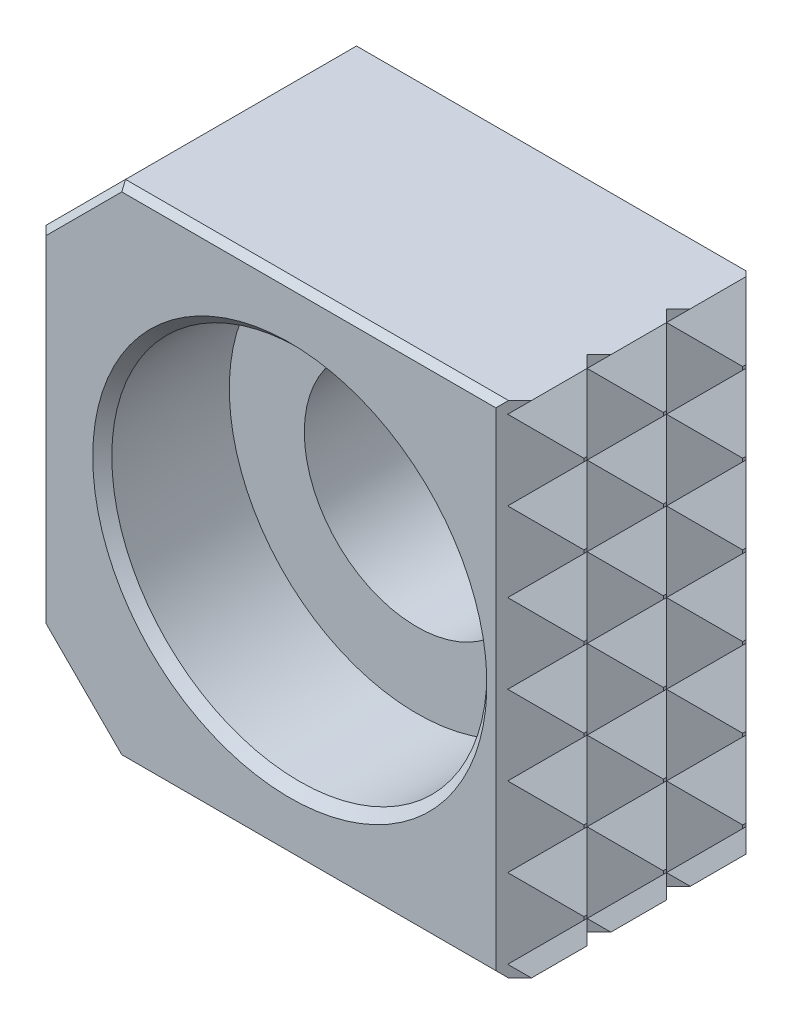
ISO-10303-21;
HEADER;
FILE_DESCRIPTION(('STEP AP214'),'2;1');
FILE_NAME('part.step','',(''),(''),'','','');
FILE_SCHEMA(('AUTOMOTIVE_DESIGN { 1 0 10303 214 1 1 1 1 }'));
ENDSEC;
DATA;
#1=APPLICATION_CONTEXT('core data for automotive mechanical design processes');
#2=APPLICATION_PROTOCOL_DEFINITION('international standard','automotive_design',2000,#1);
#3=PRODUCT_CONTEXT('',#1,'mechanical');
#4=PRODUCT('Part','Part','',(#3));
#5=PRODUCT_RELATED_PRODUCT_CATEGORY('part','',(#4));
#6=PRODUCT_DEFINITION_FORMATION('','',#4);
#7=PRODUCT_DEFINITION_CONTEXT('part definition',#1,'design');
#8=PRODUCT_DEFINITION('design','',#6,#7);
#9=PRODUCT_DEFINITION_SHAPE('','',#8);
#10=(LENGTH_UNIT() NAMED_UNIT(*) SI_UNIT(.MILLI.,.METRE.));
#11=(NAMED_UNIT(*) PLANE_ANGLE_UNIT() SI_UNIT($,.RADIAN.));
#12=(NAMED_UNIT(*) SI_UNIT($,.STERADIAN.) SOLID_ANGLE_UNIT());
#13=UNCERTAINTY_MEASURE_WITH_UNIT(LENGTH_MEASURE(1.E-05),#10,'distance_accuracy_value','');
#14=(GEOMETRIC_REPRESENTATION_CONTEXT(3) GLOBAL_UNCERTAINTY_ASSIGNED_CONTEXT((#13)) GLOBAL_UNIT_ASSIGNED_CONTEXT((#10,
#11,#12)) REPRESENTATION_CONTEXT('',''));
#15=CARTESIAN_POINT('',(0.,0.,0.));
#16=DIRECTION('',(0.,0.,1.));
#17=DIRECTION('',(1.,0.,0.));
#18=AXIS2_PLACEMENT_3D('',#15,#16,#17);
#19=CARTESIAN_POINT('',(10.,-10.,10.));
#20=DIRECTION('',(-1.,0.,0.));
#21=DIRECTION('',(0.,-1.,0.));
#22=AXIS2_PLACEMENT_3D('',#19,#20,#21);
#23=PLANE('',#22);
#24=DIRECTION('',(0.,-1.,0.));
#25=VECTOR('',#24,1.);
#26=CARTESIAN_POINT('',(10.,-10.,8.1115));
#27=LINE('',#26,#25);
#28=CARTESIAN_POINT('',(10.,-1.52399985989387,8.1115));
#29=VERTEX_POINT('',#28);
#30=CARTESIAN_POINT('',(10.,-1.65099985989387,8.1115));
#31=VERTEX_POINT('',#30);
#32=EDGE_CURVE('E767',#29,#31,#27,.T.);
#33=ORIENTED_EDGE('',*,*,#32,.F.);
#34=DIRECTION('',(0.,0.,-1.));
#35=VECTOR('',#34,1.);
#36=CARTESIAN_POINT('',(10.,-1.52399985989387,10.));
#37=LINE('',#36,#35);
#38=CARTESIAN_POINT('',(10.,-1.52399985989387,8.2385));
#39=VERTEX_POINT('',#38);
#40=EDGE_CURVE('E913',#39,#29,#37,.T.);
#41=ORIENTED_EDGE('',*,*,#40,.F.);
#42=DIRECTION('',(0.,1.,0.));
#43=VECTOR('',#42,1.);
#44=CARTESIAN_POINT('',(10.,-10.,8.2385));
#45=LINE('',#44,#43);
#46=CARTESIAN_POINT('',(10.,-1.65099985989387,8.2385));
#47=VERTEX_POINT('',#46);
#48=EDGE_CURVE('E720',#47,#39,#45,.T.);
#49=ORIENTED_EDGE('',*,*,#48,.F.);
#50=DIRECTION('',(0.,0.,1.));
#51=VECTOR('',#50,1.);
#52=CARTESIAN_POINT('',(10.,-1.65099985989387,10.));
#53=LINE('',#52,#51);
#54=EDGE_CURVE('E904',#31,#47,#53,.T.);
#55=ORIENTED_EDGE('',*,*,#54,.F.);
#56=EDGE_LOOP('',(#33,#41,#49,#55));
#57=FACE_BOUND('',#56,.T.);
#58=ADVANCED_FACE('F14',(#57),#23,.F.);
#59=CARTESIAN_POINT('',(10.,-1.65099985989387,1.7615));
#60=VERTEX_POINT('',#59);
#61=CARTESIAN_POINT('',(10.,-1.65099985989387,1.8885));
#62=VERTEX_POINT('',#61);
#63=EDGE_CURVE('E908',#60,#62,#53,.T.);
#64=ORIENTED_EDGE('',*,*,#63,.F.);
#65=DIRECTION('',(0.,1.,0.));
#66=VECTOR('',#65,1.);
#67=CARTESIAN_POINT('',(10.,-10.,1.7615));
#68=LINE('',#67,#66);
#69=CARTESIAN_POINT('',(10.,-1.52399985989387,1.7615));
#70=VERTEX_POINT('',#69);
#71=EDGE_CURVE('E666',#60,#70,#68,.T.);
#72=ORIENTED_EDGE('',*,*,#71,.T.);
#73=CARTESIAN_POINT('',(10.,-1.52399985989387,1.8885));
#74=VERTEX_POINT('',#73);
#75=EDGE_CURVE('E909',#74,#70,#37,.T.);
#76=ORIENTED_EDGE('',*,*,#75,.F.);
#77=DIRECTION('',(0.,-1.,0.));
#78=VECTOR('',#77,1.);
#79=CARTESIAN_POINT('',(10.,-10.,1.8885));
#80=LINE('',#79,#78);
#81=EDGE_CURVE('E614',#74,#62,#80,.T.);
#82=ORIENTED_EDGE('',*,*,#81,.T.);
#83=EDGE_LOOP('',(#64,#72,#76,#82));
#84=FACE_BOUND('',#83,.T.);
#85=ADVANCED_FACE('F1012',(#84),#23,.F.);
#86=CARTESIAN_POINT('',(10.,-1.65099985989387,4.9365));
#87=VERTEX_POINT('',#86);
#88=CARTESIAN_POINT('',(10.,-1.65099985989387,5.0635));
#89=VERTEX_POINT('',#88);
#90=EDGE_CURVE('E907',#87,#89,#53,.T.);
#91=ORIENTED_EDGE('',*,*,#90,.F.);
#92=DIRECTION('',(0.,1.,0.));
#93=VECTOR('',#92,1.);
#94=CARTESIAN_POINT('',(10.,-10.,4.9365));
#95=LINE('',#94,#93);
#96=CARTESIAN_POINT('',(10.,-1.52399985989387,4.9365));
#97=VERTEX_POINT('',#96);
#98=EDGE_CURVE('E563',#87,#97,#95,.T.);
#99=ORIENTED_EDGE('',*,*,#98,.T.);
#100=CARTESIAN_POINT('',(10.,-1.52399985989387,5.0635));
#101=VERTEX_POINT('',#100);
#102=EDGE_CURVE('E912',#101,#97,#37,.T.);
#103=ORIENTED_EDGE('',*,*,#102,.F.);
#104=DIRECTION('',(0.,1.,0.));
#105=VECTOR('',#104,1.);
#106=CARTESIAN_POINT('',(10.,-10.,5.0635));
#107=LINE('',#106,#105);
#108=EDGE_CURVE('E515',#89,#101,#107,.T.);
#109=ORIENTED_EDGE('',*,*,#108,.F.);
#110=EDGE_LOOP('',(#91,#99,#103,#109));
#111=FACE_BOUND('',#110,.T.);
#112=ADVANCED_FACE('F1018',(#111),#23,.F.);
#113=DIRECTION('',(0.,-1.,0.));
#114=VECTOR('',#113,1.);
#115=CARTESIAN_POINT('',(10.,-10.,8.1115));
#116=LINE('',#115,#114);
#117=CARTESIAN_POINT('',(10.,-4.69899985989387,8.1115));
#118=VERTEX_POINT('',#117);
#119=CARTESIAN_POINT('',(10.,-4.82599985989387,8.1115));
#120=VERTEX_POINT('',#119);
#121=EDGE_CURVE('E765',#118,#120,#116,.T.);
#122=ORIENTED_EDGE('',*,*,#121,.F.);
#123=DIRECTION('',(0.,0.,-1.));
#124=VECTOR('',#123,1.);
#125=CARTESIAN_POINT('',(10.,-4.69899985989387,10.));
#126=LINE('',#125,#124);
#127=CARTESIAN_POINT('',(10.,-4.69899985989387,8.2385));
#128=VERTEX_POINT('',#127);
#129=EDGE_CURVE('E903',#128,#118,#126,.T.);
#130=ORIENTED_EDGE('',*,*,#129,.F.);
#131=DIRECTION('',(0.,1.,0.));
#132=VECTOR('',#131,1.);
#133=CARTESIAN_POINT('',(10.,-10.,8.2385));
#134=LINE('',#133,#132);
#135=CARTESIAN_POINT('',(10.,-4.82599985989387,8.2385));
#136=VERTEX_POINT('',#135);
#137=EDGE_CURVE('E718',#136,#128,#134,.T.);
#138=ORIENTED_EDGE('',*,*,#137,.F.);
#139=DIRECTION('',(0.,0.,1.));
#140=VECTOR('',#139,1.);
#141=CARTESIAN_POINT('',(10.,-4.82599985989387,10.));
#142=LINE('',#141,#140);
#143=EDGE_CURVE('E894',#120,#136,#142,.T.);
#144=ORIENTED_EDGE('',*,*,#143,.F.);
#145=EDGE_LOOP('',(#122,#130,#138,#144));
#146=FACE_BOUND('',#145,.T.);
#147=ADVANCED_FACE('F2103',(#146),#23,.F.);
#148=CARTESIAN_POINT('',(10.,-4.82599985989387,1.7615));
#149=VERTEX_POINT('',#148);
#150=CARTESIAN_POINT('',(10.,-4.82599985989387,1.8885));
#151=VERTEX_POINT('',#150);
#152=EDGE_CURVE('E898',#149,#151,#142,.T.);
#153=ORIENTED_EDGE('',*,*,#152,.F.);
#154=DIRECTION('',(0.,1.,0.));
#155=VECTOR('',#154,1.);
#156=CARTESIAN_POINT('',(10.,-10.,1.7615));
#157=LINE('',#156,#155);
#158=CARTESIAN_POINT('',(10.,-4.69899985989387,1.7615));
#159=VERTEX_POINT('',#158);
#160=EDGE_CURVE('E663',#149,#159,#157,.T.);
#161=ORIENTED_EDGE('',*,*,#160,.T.);
#162=CARTESIAN_POINT('',(10.,-4.69899985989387,1.8885));
#163=VERTEX_POINT('',#162);
#164=EDGE_CURVE('E899',#163,#159,#126,.T.);
#165=ORIENTED_EDGE('',*,*,#164,.F.);
#166=DIRECTION('',(0.,-1.,0.));
#167=VECTOR('',#166,1.);
#168=CARTESIAN_POINT('',(10.,-10.,1.8885));
#169=LINE('',#168,#167);
#170=EDGE_CURVE('E611',#163,#151,#169,.T.);
#171=ORIENTED_EDGE('',*,*,#170,.T.);
#172=EDGE_LOOP('',(#153,#161,#165,#171));
#173=FACE_BOUND('',#172,.T.);
#174=ADVANCED_FACE('F2111',(#173),#23,.F.);
#175=CARTESIAN_POINT('',(10.,-4.82599985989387,4.9365));
#176=VERTEX_POINT('',#175);
#177=CARTESIAN_POINT('',(10.,-4.82599985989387,5.0635));
#178=VERTEX_POINT('',#177);
#179=EDGE_CURVE('E897',#176,#178,#142,.T.);
#180=ORIENTED_EDGE('',*,*,#179,.F.);
#181=DIRECTION('',(0.,1.,0.));
#182=VECTOR('',#181,1.);
#183=CARTESIAN_POINT('',(10.,-10.,4.9365));
#184=LINE('',#183,#182);
#185=CARTESIAN_POINT('',(10.,-4.69899985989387,4.9365));
#186=VERTEX_POINT('',#185);
#187=EDGE_CURVE('E560',#176,#186,#184,.T.);
#188=ORIENTED_EDGE('',*,*,#187,.T.);
#189=CARTESIAN_POINT('',(10.,-4.69899985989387,5.0635));
#190=VERTEX_POINT('',#189);
#191=EDGE_CURVE('E902',#190,#186,#126,.T.);
#192=ORIENTED_EDGE('',*,*,#191,.F.);
#193=DIRECTION('',(0.,1.,0.));
#194=VECTOR('',#193,1.);
#195=CARTESIAN_POINT('',(10.,-10.,5.0635));
#196=LINE('',#195,#194);
#197=EDGE_CURVE('E513',#178,#190,#196,.T.);
#198=ORIENTED_EDGE('',*,*,#197,.F.);
#199=EDGE_LOOP('',(#180,#188,#192,#198));
#200=FACE_BOUND('',#199,.T.);
#201=ADVANCED_FACE('F2120',(#200),#23,.F.);
#202=DIRECTION('',(0.,-1.,0.));
#203=VECTOR('',#202,1.);
#204=CARTESIAN_POINT('',(10.,-10.,8.1115));
#205=LINE('',#204,#203);
#206=CARTESIAN_POINT('',(10.,-7.87399985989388,8.1115));
#207=VERTEX_POINT('',#206);
#208=CARTESIAN_POINT('',(10.,-8.00099985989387,8.1115));
#209=VERTEX_POINT('',#208);
#210=EDGE_CURVE('E783',#207,#209,#205,.T.);
#211=ORIENTED_EDGE('',*,*,#210,.F.);
#212=DIRECTION('',(0.,0.,-1.));
#213=VECTOR('',#212,1.);
#214=CARTESIAN_POINT('',(10.,-7.87399985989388,10.));
#215=LINE('',#214,#213);
#216=CARTESIAN_POINT('',(10.,-7.87399985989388,8.2385));
#217=VERTEX_POINT('',#216);
#218=EDGE_CURVE('E893',#217,#207,#215,.T.);
#219=ORIENTED_EDGE('',*,*,#218,.F.);
#220=DIRECTION('',(0.,1.,0.));
#221=VECTOR('',#220,1.);
#222=CARTESIAN_POINT('',(10.,-10.,8.2385));
#223=LINE('',#222,#221);
#224=CARTESIAN_POINT('',(10.,-8.00099985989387,8.2385));
#225=VERTEX_POINT('',#224);
#226=EDGE_CURVE('E735',#225,#217,#223,.T.);
#227=ORIENTED_EDGE('',*,*,#226,.F.);
#228=DIRECTION('',(0.,0.,1.));
#229=VECTOR('',#228,1.);
#230=CARTESIAN_POINT('',(10.,-8.00099985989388,10.));
#231=LINE('',#230,#229);
#232=EDGE_CURVE('E884',#209,#225,#231,.T.);
#233=ORIENTED_EDGE('',*,*,#232,.F.);
#234=EDGE_LOOP('',(#211,#219,#227,#233));
#235=FACE_BOUND('',#234,.T.);
#236=ADVANCED_FACE('F2129',(#235),#23,.F.);
#237=CARTESIAN_POINT('',(10.,-8.00099985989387,1.7615));
#238=VERTEX_POINT('',#237);
#239=CARTESIAN_POINT('',(10.,-8.00099985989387,1.8885));
#240=VERTEX_POINT('',#239);
#241=EDGE_CURVE('E888',#238,#240,#231,.T.);
#242=ORIENTED_EDGE('',*,*,#241,.F.);
#243=DIRECTION('',(0.,1.,0.));
#244=VECTOR('',#243,1.);
#245=CARTESIAN_POINT('',(10.,-10.,1.7615));
#246=LINE('',#245,#244);
#247=CARTESIAN_POINT('',(10.,-7.87399985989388,1.7615));
#248=VERTEX_POINT('',#247);
#249=EDGE_CURVE('E681',#238,#248,#246,.T.);
#250=ORIENTED_EDGE('',*,*,#249,.T.);
#251=CARTESIAN_POINT('',(10.,-7.87399985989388,1.8885));
#252=VERTEX_POINT('',#251);
#253=EDGE_CURVE('E889',#252,#248,#215,.T.);
#254=ORIENTED_EDGE('',*,*,#253,.F.);
#255=DIRECTION('',(0.,-1.,0.));
#256=VECTOR('',#255,1.);
#257=CARTESIAN_POINT('',(10.,-10.,1.8885));
#258=LINE('',#257,#256);
#259=EDGE_CURVE('E631',#252,#240,#258,.T.);
#260=ORIENTED_EDGE('',*,*,#259,.T.);
#261=EDGE_LOOP('',(#242,#250,#254,#260));
#262=FACE_BOUND('',#261,.T.);
#263=ADVANCED_FACE('F2138',(#262),#23,.F.);
#264=CARTESIAN_POINT('',(10.,-8.00099985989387,4.9365));
#265=VERTEX_POINT('',#264);
#266=CARTESIAN_POINT('',(10.,-8.00099985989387,5.0635));
#267=VERTEX_POINT('',#266);
#268=EDGE_CURVE('E887',#265,#267,#231,.T.);
#269=ORIENTED_EDGE('',*,*,#268,.F.);
#270=DIRECTION('',(0.,1.,0.));
#271=VECTOR('',#270,1.);
#272=CARTESIAN_POINT('',(10.,-10.,4.9365));
#273=LINE('',#272,#271);
#274=CARTESIAN_POINT('',(10.,-7.87399985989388,4.9365));
#275=VERTEX_POINT('',#274);
#276=EDGE_CURVE('E579',#265,#275,#273,.T.);
#277=ORIENTED_EDGE('',*,*,#276,.T.);
#278=CARTESIAN_POINT('',(10.,-7.87399985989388,5.0635));
#279=VERTEX_POINT('',#278);
#280=EDGE_CURVE('E892',#279,#275,#215,.T.);
#281=ORIENTED_EDGE('',*,*,#280,.F.);
#282=DIRECTION('',(0.,1.,0.));
#283=VECTOR('',#282,1.);
#284=CARTESIAN_POINT('',(10.,-10.,5.0635));
#285=LINE('',#284,#283);
#286=EDGE_CURVE('E530',#267,#279,#285,.T.);
#287=ORIENTED_EDGE('',*,*,#286,.F.);
#288=EDGE_LOOP('',(#269,#277,#281,#287));
#289=FACE_BOUND('',#288,.T.);
#290=ADVANCED_FACE('F2147',(#289),#23,.F.);
#291=DIRECTION('',(0.,-1.,0.));
#292=VECTOR('',#291,1.);
#293=CARTESIAN_POINT('',(10.,-10.,8.1115));
#294=LINE('',#293,#292);
#295=CARTESIAN_POINT('',(10.,8.00099985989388,8.1115));
#296=VERTEX_POINT('',#295);
#297=CARTESIAN_POINT('',(10.,7.87399985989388,8.1115));
#298=VERTEX_POINT('',#297);
#299=EDGE_CURVE('E803',#296,#298,#294,.T.);
#300=ORIENTED_EDGE('',*,*,#299,.F.);
#301=DIRECTION('',(0.,0.,1.));
#302=VECTOR('',#301,1.);
#303=CARTESIAN_POINT('',(10.,8.00099985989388,10.));
#304=LINE('',#303,#302);
#305=CARTESIAN_POINT('',(10.,8.00099985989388,8.2385));
#306=VERTEX_POINT('',#305);
#307=EDGE_CURVE('E870',#296,#306,#304,.T.);
#308=ORIENTED_EDGE('',*,*,#307,.T.);
#309=DIRECTION('',(0.,1.,0.));
#310=VECTOR('',#309,1.);
#311=CARTESIAN_POINT('',(10.,-10.,8.2385));
#312=LINE('',#311,#310);
#313=CARTESIAN_POINT('',(10.,7.87399985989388,8.2385));
#314=VERTEX_POINT('',#313);
#315=EDGE_CURVE('E753',#314,#306,#312,.T.);
#316=ORIENTED_EDGE('',*,*,#315,.F.);
#317=DIRECTION('',(0.,0.,-1.));
#318=VECTOR('',#317,1.);
#319=CARTESIAN_POINT('',(10.,7.87399985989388,10.));
#320=LINE('',#319,#318);
#321=EDGE_CURVE('E869',#314,#298,#320,.T.);
#322=ORIENTED_EDGE('',*,*,#321,.T.);
#323=EDGE_LOOP('',(#300,#308,#316,#322));
#324=FACE_BOUND('',#323,.T.);
#325=ADVANCED_FACE('F2156',(#324),#23,.F.);
#326=CARTESIAN_POINT('',(10.,7.87399985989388,1.8885));
#327=VERTEX_POINT('',#326);
#328=CARTESIAN_POINT('',(10.,7.87399985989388,1.7615));
#329=VERTEX_POINT('',#328);
#330=EDGE_CURVE('E865',#327,#329,#320,.T.);
#331=ORIENTED_EDGE('',*,*,#330,.T.);
#332=DIRECTION('',(0.,1.,0.));
#333=VECTOR('',#332,1.);
#334=CARTESIAN_POINT('',(10.,-10.,1.7615));
#335=LINE('',#334,#333);
#336=CARTESIAN_POINT('',(10.,8.00099985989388,1.7615));
#337=VERTEX_POINT('',#336);
#338=EDGE_CURVE('E703',#329,#337,#335,.T.);
#339=ORIENTED_EDGE('',*,*,#338,.T.);
#340=CARTESIAN_POINT('',(10.,8.00099985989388,1.8885));
#341=VERTEX_POINT('',#340);
#342=EDGE_CURVE('E874',#337,#341,#304,.T.);
#343=ORIENTED_EDGE('',*,*,#342,.T.);
#344=DIRECTION('',(0.,-1.,0.));
#345=VECTOR('',#344,1.);
#346=CARTESIAN_POINT('',(10.,-10.,1.8885));
#347=LINE('',#346,#345);
#348=EDGE_CURVE('E652',#341,#327,#347,.T.);
#349=ORIENTED_EDGE('',*,*,#348,.T.);
#350=EDGE_LOOP('',(#331,#339,#343,#349));
#351=FACE_BOUND('',#350,.T.);
#352=ADVANCED_FACE('F2165',(#351),#23,.F.);
#353=CARTESIAN_POINT('',(10.,7.87399985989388,5.0635));
#354=VERTEX_POINT('',#353);
#355=CARTESIAN_POINT('',(10.,7.87399985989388,4.9365));
#356=VERTEX_POINT('',#355);
#357=EDGE_CURVE('E868',#354,#356,#320,.T.);
#358=ORIENTED_EDGE('',*,*,#357,.T.);
#359=DIRECTION('',(0.,1.,0.));
#360=VECTOR('',#359,1.);
#361=CARTESIAN_POINT('',(10.,-10.,4.9365));
#362=LINE('',#361,#360);
#363=CARTESIAN_POINT('',(10.,8.00099985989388,4.9365));
#364=VERTEX_POINT('',#363);
#365=EDGE_CURVE('E600',#356,#364,#362,.T.);
#366=ORIENTED_EDGE('',*,*,#365,.T.);
#367=CARTESIAN_POINT('',(10.,8.00099985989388,5.0635));
#368=VERTEX_POINT('',#367);
#369=EDGE_CURVE('E873',#364,#368,#304,.T.);
#370=ORIENTED_EDGE('',*,*,#369,.T.);
#371=DIRECTION('',(0.,1.,0.));
#372=VECTOR('',#371,1.);
#373=CARTESIAN_POINT('',(10.,-10.,5.0635));
#374=LINE('',#373,#372);
#375=EDGE_CURVE('E550',#354,#368,#374,.T.);
#376=ORIENTED_EDGE('',*,*,#375,.F.);
#377=EDGE_LOOP('',(#358,#366,#370,#376));
#378=FACE_BOUND('',#377,.T.);
#379=ADVANCED_FACE('F2174',(#378),#23,.F.);
#380=DIRECTION('',(0.,-1.,0.));
#381=VECTOR('',#380,1.);
#382=CARTESIAN_POINT('',(10.,-10.,8.1115));
#383=LINE('',#382,#381);
#384=CARTESIAN_POINT('',(10.,4.82599985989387,8.1115));
#385=VERTEX_POINT('',#384);
#386=CARTESIAN_POINT('',(10.,4.69899985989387,8.1115));
#387=VERTEX_POINT('',#386);
#388=EDGE_CURVE('E796',#385,#387,#383,.T.);
#389=ORIENTED_EDGE('',*,*,#388,.F.);
#390=DIRECTION('',(0.,0.,1.));
#391=VECTOR('',#390,1.);
#392=CARTESIAN_POINT('',(10.,4.82599985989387,10.));
#393=LINE('',#392,#391);
#394=CARTESIAN_POINT('',(10.,4.82599985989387,8.2385));
#395=VERTEX_POINT('',#394);
#396=EDGE_CURVE('E860',#385,#395,#393,.T.);
#397=ORIENTED_EDGE('',*,*,#396,.T.);
#398=DIRECTION('',(0.,1.,0.));
#399=VECTOR('',#398,1.);
#400=CARTESIAN_POINT('',(10.,-10.,8.2385));
#401=LINE('',#400,#399);
#402=CARTESIAN_POINT('',(10.,4.69899985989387,8.2385));
#403=VERTEX_POINT('',#402);
#404=EDGE_CURVE('E747',#403,#395,#401,.T.);
#405=ORIENTED_EDGE('',*,*,#404,.F.);
#406=DIRECTION('',(0.,0.,-1.));
#407=VECTOR('',#406,1.);
#408=CARTESIAN_POINT('',(10.,4.69899985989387,10.));
#409=LINE('',#408,#407);
#410=EDGE_CURVE('E859',#403,#387,#409,.T.);
#411=ORIENTED_EDGE('',*,*,#410,.T.);
#412=EDGE_LOOP('',(#389,#397,#405,#411));
#413=FACE_BOUND('',#412,.T.);
#414=ADVANCED_FACE('F1250',(#413),#23,.F.);
#415=CARTESIAN_POINT('',(10.,4.69899985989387,1.8885));
#416=VERTEX_POINT('',#415);
#417=CARTESIAN_POINT('',(10.,4.69899985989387,1.7615));
#418=VERTEX_POINT('',#417);
#419=EDGE_CURVE('E855',#416,#418,#409,.T.);
#420=ORIENTED_EDGE('',*,*,#419,.T.);
#421=DIRECTION('',(0.,1.,0.));
#422=VECTOR('',#421,1.);
#423=CARTESIAN_POINT('',(10.,-10.,1.7615));
#424=LINE('',#423,#422);
#425=CARTESIAN_POINT('',(10.,4.82599985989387,1.7615));
#426=VERTEX_POINT('',#425);
#427=EDGE_CURVE('E694',#418,#426,#424,.T.);
#428=ORIENTED_EDGE('',*,*,#427,.T.);
#429=CARTESIAN_POINT('',(10.,4.82599985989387,1.8885));
#430=VERTEX_POINT('',#429);
#431=EDGE_CURVE('E864',#426,#430,#393,.T.);
#432=ORIENTED_EDGE('',*,*,#431,.T.);
#433=DIRECTION('',(0.,-1.,0.));
#434=VECTOR('',#433,1.);
#435=CARTESIAN_POINT('',(10.,-10.,1.8885));
#436=LINE('',#435,#434);
#437=EDGE_CURVE('E643',#430,#416,#436,.T.);
#438=ORIENTED_EDGE('',*,*,#437,.T.);
#439=EDGE_LOOP('',(#420,#428,#432,#438));
#440=FACE_BOUND('',#439,.T.);
#441=ADVANCED_FACE('F1245',(#440),#23,.F.);
#442=CARTESIAN_POINT('',(10.,4.69899985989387,5.0635));
#443=VERTEX_POINT('',#442);
#444=CARTESIAN_POINT('',(10.,4.69899985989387,4.9365));
#445=VERTEX_POINT('',#444);
#446=EDGE_CURVE('E858',#443,#445,#409,.T.);
#447=ORIENTED_EDGE('',*,*,#446,.T.);
#448=DIRECTION('',(0.,1.,0.));
#449=VECTOR('',#448,1.);
#450=CARTESIAN_POINT('',(10.,-10.,4.9365));
#451=LINE('',#450,#449);
#452=CARTESIAN_POINT('',(10.,4.82599985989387,4.9365));
#453=VERTEX_POINT('',#452);
#454=EDGE_CURVE('E591',#445,#453,#451,.T.);
#455=ORIENTED_EDGE('',*,*,#454,.T.);
#456=CARTESIAN_POINT('',(10.,4.82599985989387,5.0635));
#457=VERTEX_POINT('',#456);
#458=EDGE_CURVE('E863',#453,#457,#393,.T.);
#459=ORIENTED_EDGE('',*,*,#458,.T.);
#460=DIRECTION('',(0.,1.,0.));
#461=VECTOR('',#460,1.);
#462=CARTESIAN_POINT('',(10.,-10.,5.0635));
#463=LINE('',#462,#461);
#464=EDGE_CURVE('E543',#443,#457,#463,.T.);
#465=ORIENTED_EDGE('',*,*,#464,.F.);
#466=EDGE_LOOP('',(#447,#455,#459,#465));
#467=FACE_BOUND('',#466,.T.);
#468=ADVANCED_FACE('F1241',(#467),#23,.F.);
#469=CARTESIAN_POINT('',(10.,-10.,10.));
#470=DIRECTION('',(0.,-1.,0.));
#471=DIRECTION('',(1.,0.,0.));
#472=AXIS2_PLACEMENT_3D('',#469,#470,#471);
#473=PLANE('',#472);
#474=DIRECTION('',(-0.707106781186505,0.,0.70710678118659));
#475=VECTOR('',#474,1.);
#476=CARTESIAN_POINT('',(10.0635,-10.,8.175));
#477=LINE('',#476,#475);
#478=CARTESIAN_POINT('',(8.95100004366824,-10.,9.28749995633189));
#479=VERTEX_POINT('',#478);
#480=CARTESIAN_POINT('',(8.49250000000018,-10.,9.746));
#481=VERTEX_POINT('',#480);
#482=EDGE_CURVE('E484',#479,#481,#477,.T.);
#483=ORIENTED_EDGE('',*,*,#482,.T.);
#484=DIRECTION('',(-1.,0.,0.));
#485=VECTOR('',#484,1.);
#486=CARTESIAN_POINT('',(-6.825,-10.,9.746));
#487=LINE('',#486,#485);
#488=CARTESIAN_POINT('',(-6.825,-10.,9.746));
#489=VERTEX_POINT('',#488);
#490=EDGE_CURVE('E974',#481,#489,#487,.T.);
#491=ORIENTED_EDGE('',*,*,#490,.T.);
#492=DIRECTION('',(0.,0.,-1.));
#493=VECTOR('',#492,1.);
#494=CARTESIAN_POINT('',(-6.825,-10.,0.));
#495=LINE('',#494,#493);
#496=CARTESIAN_POINT('',(-6.825,-10.,0.508));
#497=VERTEX_POINT('',#496);
#498=EDGE_CURVE('E933',#489,#497,#495,.T.);
#499=ORIENTED_EDGE('',*,*,#498,.T.);
#500=DIRECTION('',(1.,0.,0.));
#501=VECTOR('',#500,1.);
#502=CARTESIAN_POINT('',(10.,-10.,0.508));
#503=LINE('',#502,#501);
#504=CARTESIAN_POINT('',(8.74650000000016,-10.,0.508));
#505=VERTEX_POINT('',#504);
#506=EDGE_CURVE('E958',#497,#505,#503,.T.);
#507=ORIENTED_EDGE('',*,*,#506,.T.);
#508=DIRECTION('',(-0.707106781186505,0.,-0.70710678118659));
#509=VECTOR('',#508,1.);
#510=CARTESIAN_POINT('',(10.0635,-10.,1.825));
#511=LINE('',#510,#509);
#512=CARTESIAN_POINT('',(8.95100004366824,-10.,0.712500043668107));
#513=VERTEX_POINT('',#512);
#514=EDGE_CURVE('E481',#513,#505,#511,.T.);
#515=ORIENTED_EDGE('',*,*,#514,.F.);
#516=DIRECTION('',(0.,0.,1.));
#517=VECTOR('',#516,1.);
#518=CARTESIAN_POINT('',(8.95100004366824,-10.,10.));
#519=LINE('',#518,#517);
#520=CARTESIAN_POINT('',(8.95100004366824,-10.,2.93749995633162));
#521=VERTEX_POINT('',#520);
#522=EDGE_CURVE('E480',#513,#521,#519,.T.);
#523=ORIENTED_EDGE('',*,*,#522,.T.);
#524=DIRECTION('',(0.707106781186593,0.,-0.707106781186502));
#525=VECTOR('',#524,1.);
#526=CARTESIAN_POINT('',(8.476,-10.,3.41249999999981));
#527=LINE('',#526,#525);
#528=CARTESIAN_POINT('',(8.476,-10.,3.41249999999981));
#529=VERTEX_POINT('',#528);
#530=EDGE_CURVE('E456',#529,#521,#527,.T.);
#531=ORIENTED_EDGE('',*,*,#530,.F.);
#532=DIRECTION('',(-0.707106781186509,0.,-0.707106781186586));
#533=VECTOR('',#532,1.);
#534=CARTESIAN_POINT('',(10.0635,-10.,5.));
#535=LINE('',#534,#533);
#536=CARTESIAN_POINT('',(8.95100004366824,-10.,3.88750004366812));
#537=VERTEX_POINT('',#536);
#538=EDGE_CURVE('E466',#537,#529,#535,.T.);
#539=ORIENTED_EDGE('',*,*,#538,.F.);
#540=CARTESIAN_POINT('',(8.95100004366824,-10.,6.11249995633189));
#541=VERTEX_POINT('',#540);
#542=EDGE_CURVE('E883',#537,#541,#519,.T.);
#543=ORIENTED_EDGE('',*,*,#542,.T.);
#544=DIRECTION('',(-0.707106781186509,0.,0.707106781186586));
#545=VECTOR('',#544,1.);
#546=CARTESIAN_POINT('',(10.0635,-10.,5.));
#547=LINE('',#546,#545);
#548=CARTESIAN_POINT('',(8.476,-10.,6.58750000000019));
#549=VERTEX_POINT('',#548);
#550=EDGE_CURVE('E473',#541,#549,#547,.T.);
#551=ORIENTED_EDGE('',*,*,#550,.T.);
#552=DIRECTION('',(0.707106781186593,0.,0.707106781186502));
#553=VECTOR('',#552,1.);
#554=CARTESIAN_POINT('',(8.476,-10.,6.58750000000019));
#555=LINE('',#554,#553);
#556=CARTESIAN_POINT('',(8.95100004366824,-10.,7.06250004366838));
#557=VERTEX_POINT('',#556);
#558=EDGE_CURVE('E1178',#549,#557,#555,.T.);
#559=ORIENTED_EDGE('',*,*,#558,.T.);
#560=EDGE_CURVE('E880',#557,#479,#519,.T.);
#561=ORIENTED_EDGE('',*,*,#560,.T.);
#562=EDGE_LOOP('',(#483,#491,#499,#507,#515,#523,#531,#539,#543,#551,#559,#561));
#563=FACE_BOUND('',#562,.T.);
#564=ADVANCED_FACE('F477',(#563),#473,.T.);
#565=CARTESIAN_POINT('',(10.,10.,10.));
#566=DIRECTION('',(0.,0.,-1.));
#567=DIRECTION('',(1.,0.,0.));
#568=AXIS2_PLACEMENT_3D('',#565,#566,#567);
#569=PLANE('',#568);
#570=CARTESIAN_POINT('',(0.,0.,10.));
#571=DIRECTION('',(0.,0.,-1.));
#572=DIRECTION('',(-1.,0.,0.));
#573=AXIS2_PLACEMENT_3D('',#570,#571,#572);
#574=CIRCLE('',#573,7.881);
#575=CARTESIAN_POINT('',(-7.881,0.,10.));
#576=VERTEX_POINT('',#575);
#577=EDGE_CURVE('E9',#576,#576,#574,.T.);
#578=ORIENTED_EDGE('',*,*,#577,.T.);
#579=EDGE_LOOP('',(#578));
#580=FACE_BOUND('',#579,.T.);
#581=DIRECTION('',(0.707106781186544,-0.707106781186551,0.));
#582=VECTOR('',#581,1.);
#583=CARTESIAN_POINT('',(-6.64539487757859,-9.82039487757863,10.));
#584=LINE('',#583,#582);
#585=CARTESIAN_POINT('',(-9.746,-6.71978975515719,10.));
#586=VERTEX_POINT('',#585);
#587=CARTESIAN_POINT('',(-6.71978975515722,-9.746,10.));
#588=VERTEX_POINT('',#587);
#589=EDGE_CURVE('E983',#586,#588,#584,.T.);
#590=ORIENTED_EDGE('',*,*,#589,.T.);
#591=DIRECTION('',(1.,0.,0.));
#592=VECTOR('',#591,1.);
#593=CARTESIAN_POINT('',(8.23850000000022,-9.746,10.));
#594=LINE('',#593,#592);
#595=CARTESIAN_POINT('',(8.23850000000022,-9.746,10.));
#596=VERTEX_POINT('',#595);
#597=EDGE_CURVE('E985',#588,#596,#594,.T.);
#598=ORIENTED_EDGE('',*,*,#597,.T.);
#599=DIRECTION('',(0.,-1.,0.));
#600=VECTOR('',#599,1.);
#601=CARTESIAN_POINT('',(8.23850000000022,10.,10.));
#602=LINE('',#601,#600);
#603=CARTESIAN_POINT('',(8.23850000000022,9.746,10.));
#604=VERTEX_POINT('',#603);
#605=EDGE_CURVE('E759',#604,#596,#602,.T.);
#606=ORIENTED_EDGE('',*,*,#605,.F.);
#607=DIRECTION('',(-1.,0.,0.));
#608=VECTOR('',#607,1.);
#609=CARTESIAN_POINT('',(-6.825,9.746,10.));
#610=LINE('',#609,#608);
#611=CARTESIAN_POINT('',(-6.71978975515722,9.746,10.));
#612=VERTEX_POINT('',#611);
#613=EDGE_CURVE('E977',#604,#612,#610,.T.);
#614=ORIENTED_EDGE('',*,*,#613,.T.);
#615=DIRECTION('',(-0.707106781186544,-0.707106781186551,0.));
#616=VECTOR('',#615,1.);
#617=CARTESIAN_POINT('',(-9.82039487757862,6.64539487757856,10.));
#618=LINE('',#617,#616);
#619=CARTESIAN_POINT('',(-9.746,6.71978975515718,10.));
#620=VERTEX_POINT('',#619);
#621=EDGE_CURVE('E979',#612,#620,#618,.T.);
#622=ORIENTED_EDGE('',*,*,#621,.T.);
#623=DIRECTION('',(0.,-1.,0.));
#624=VECTOR('',#623,1.);
#625=CARTESIAN_POINT('',(-9.746,10.,10.));
#626=LINE('',#625,#624);
#627=EDGE_CURVE('E981',#620,#586,#626,.T.);
#628=ORIENTED_EDGE('',*,*,#627,.T.);
#629=EDGE_LOOP('',(#590,#598,#606,#614,#622,#628));
#630=FACE_BOUND('',#629,.T.);
#631=ADVANCED_FACE('F1236',(#580,#630),#569,.F.);
#632=DIRECTION('',(0.,-1.,0.));
#633=VECTOR('',#632,1.);
#634=CARTESIAN_POINT('',(10.,-10.,8.1115));
#635=LINE('',#634,#633);
#636=CARTESIAN_POINT('',(10.,1.65099985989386,8.1115));
#637=VERTEX_POINT('',#636);
#638=CARTESIAN_POINT('',(10.,1.52399985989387,8.1115));
#639=VERTEX_POINT('',#638);
#640=EDGE_CURVE('E781',#637,#639,#635,.T.);
#641=ORIENTED_EDGE('',*,*,#640,.F.);
#642=DIRECTION('',(0.,0.,1.));
#643=VECTOR('',#642,1.);
#644=CARTESIAN_POINT('',(10.,1.65099985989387,10.));
#645=LINE('',#644,#643);
#646=CARTESIAN_POINT('',(10.,1.65099985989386,8.2385));
#647=VERTEX_POINT('',#646);
#648=EDGE_CURVE('E850',#637,#647,#645,.T.);
#649=ORIENTED_EDGE('',*,*,#648,.T.);
#650=DIRECTION('',(0.,1.,0.));
#651=VECTOR('',#650,1.);
#652=CARTESIAN_POINT('',(10.,-10.,8.2385));
#653=LINE('',#652,#651);
#654=CARTESIAN_POINT('',(10.,1.52399985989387,8.2385));
#655=VERTEX_POINT('',#654);
#656=EDGE_CURVE('E733',#655,#647,#653,.T.);
#657=ORIENTED_EDGE('',*,*,#656,.F.);
#658=DIRECTION('',(0.,0.,-1.));
#659=VECTOR('',#658,1.);
#660=CARTESIAN_POINT('',(10.,1.52399985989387,10.));
#661=LINE('',#660,#659);
#662=EDGE_CURVE('E849',#655,#639,#661,.T.);
#663=ORIENTED_EDGE('',*,*,#662,.T.);
#664=EDGE_LOOP('',(#641,#649,#657,#663));
#665=FACE_BOUND('',#664,.T.);
#666=ADVANCED_FACE('F1032',(#665),#23,.F.);
#667=CARTESIAN_POINT('',(10.,1.52399985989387,1.8885));
#668=VERTEX_POINT('',#667);
#669=CARTESIAN_POINT('',(10.,1.52399985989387,1.7615));
#670=VERTEX_POINT('',#669);
#671=EDGE_CURVE('E845',#668,#670,#661,.T.);
#672=ORIENTED_EDGE('',*,*,#671,.T.);
#673=DIRECTION('',(0.,1.,0.));
#674=VECTOR('',#673,1.);
#675=CARTESIAN_POINT('',(10.,-10.,1.7615));
#676=LINE('',#675,#674);
#677=CARTESIAN_POINT('',(10.,1.65099985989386,1.7615));
#678=VERTEX_POINT('',#677);
#679=EDGE_CURVE('E678',#670,#678,#676,.T.);
#680=ORIENTED_EDGE('',*,*,#679,.T.);
#681=CARTESIAN_POINT('',(10.,1.65099985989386,1.8885));
#682=VERTEX_POINT('',#681);
#683=EDGE_CURVE('E854',#678,#682,#645,.T.);
#684=ORIENTED_EDGE('',*,*,#683,.T.);
#685=DIRECTION('',(0.,-1.,0.));
#686=VECTOR('',#685,1.);
#687=CARTESIAN_POINT('',(10.,-10.,1.8885));
#688=LINE('',#687,#686);
#689=EDGE_CURVE('E628',#682,#668,#688,.T.);
#690=ORIENTED_EDGE('',*,*,#689,.T.);
#691=EDGE_LOOP('',(#672,#680,#684,#690));
#692=FACE_BOUND('',#691,.T.);
#693=ADVANCED_FACE('F1024',(#692),#23,.F.);
#694=CARTESIAN_POINT('',(10.,1.52399985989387,5.0635));
#695=VERTEX_POINT('',#694);
#696=CARTESIAN_POINT('',(10.,1.52399985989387,4.9365));
#697=VERTEX_POINT('',#696);
#698=EDGE_CURVE('E848',#695,#697,#661,.T.);
#699=ORIENTED_EDGE('',*,*,#698,.T.);
#700=DIRECTION('',(0.,1.,0.));
#701=VECTOR('',#700,1.);
#702=CARTESIAN_POINT('',(10.,-10.,4.9365));
#703=LINE('',#702,#701);
#704=CARTESIAN_POINT('',(10.,1.65099985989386,4.9365));
#705=VERTEX_POINT('',#704);
#706=EDGE_CURVE('E576',#697,#705,#703,.T.);
#707=ORIENTED_EDGE('',*,*,#706,.T.);
#708=CARTESIAN_POINT('',(10.,1.65099985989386,5.0635));
#709=VERTEX_POINT('',#708);
#710=EDGE_CURVE('E853',#705,#709,#645,.T.);
#711=ORIENTED_EDGE('',*,*,#710,.T.);
#712=DIRECTION('',(0.,1.,0.));
#713=VECTOR('',#712,1.);
#714=CARTESIAN_POINT('',(10.,-10.,5.0635));
#715=LINE('',#714,#713);
#716=EDGE_CURVE('E528',#695,#709,#715,.T.);
#717=ORIENTED_EDGE('',*,*,#716,.F.);
#718=EDGE_LOOP('',(#699,#707,#711,#717));
#719=FACE_BOUND('',#718,.T.);
#720=ADVANCED_FACE('F1014',(#719),#23,.F.);
#721=CARTESIAN_POINT('',(-10.,10.,10.));
#722=DIRECTION('',(0.,1.,0.));
#723=DIRECTION('',(-1.,0.,0.));
#724=AXIS2_PLACEMENT_3D('',#721,#722,#723);
#725=PLANE('',#724);
#726=DIRECTION('',(0.,0.,1.));
#727=VECTOR('',#726,1.);
#728=CARTESIAN_POINT('',(-6.825,10.,10.));
#729=LINE('',#728,#727);
#730=CARTESIAN_POINT('',(-6.825,10.,0.508));
#731=VERTEX_POINT('',#730);
#732=CARTESIAN_POINT('',(-6.825,10.,9.746));
#733=VERTEX_POINT('',#732);
#734=EDGE_CURVE('E939',#731,#733,#729,.T.);
#735=ORIENTED_EDGE('',*,*,#734,.T.);
#736=DIRECTION('',(1.,0.,0.));
#737=VECTOR('',#736,1.);
#738=CARTESIAN_POINT('',(8.23850000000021,10.,9.746));
#739=LINE('',#738,#737);
#740=CARTESIAN_POINT('',(8.49250000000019,10.,9.746));
#741=VERTEX_POINT('',#740);
#742=EDGE_CURVE('E995',#733,#741,#739,.T.);
#743=ORIENTED_EDGE('',*,*,#742,.T.);
#744=DIRECTION('',(-0.707106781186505,0.,0.70710678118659));
#745=VECTOR('',#744,1.);
#746=CARTESIAN_POINT('',(10.0635,10.,8.175));
#747=LINE('',#746,#745);
#748=CARTESIAN_POINT('',(8.95100004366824,10.,9.28749995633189));
#749=VERTEX_POINT('',#748);
#750=EDGE_CURVE('E492',#749,#741,#747,.T.);
#751=ORIENTED_EDGE('',*,*,#750,.F.);
#752=DIRECTION('',(0.,0.,1.));
#753=VECTOR('',#752,1.);
#754=CARTESIAN_POINT('',(8.95100004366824,10.,10.));
#755=LINE('',#754,#753);
#756=CARTESIAN_POINT('',(8.95100004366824,10.,7.06250004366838));
#757=VERTEX_POINT('',#756);
#758=EDGE_CURVE('E875',#757,#749,#755,.T.);
#759=ORIENTED_EDGE('',*,*,#758,.F.);
#760=DIRECTION('',(0.707106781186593,0.,0.707106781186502));
#761=VECTOR('',#760,1.);
#762=CARTESIAN_POINT('',(8.476,10.,6.58750000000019));
#763=LINE('',#762,#761);
#764=CARTESIAN_POINT('',(8.476,10.,6.58750000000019));
#765=VERTEX_POINT('',#764);
#766=EDGE_CURVE('E490',#765,#757,#763,.T.);
#767=ORIENTED_EDGE('',*,*,#766,.F.);
#768=DIRECTION('',(-0.707106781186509,0.,0.707106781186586));
#769=VECTOR('',#768,1.);
#770=CARTESIAN_POINT('',(10.0635,10.,5.));
#771=LINE('',#770,#769);
#772=CARTESIAN_POINT('',(8.95100004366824,10.,6.11249995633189));
#773=VERTEX_POINT('',#772);
#774=EDGE_CURVE('E504',#773,#765,#771,.T.);
#775=ORIENTED_EDGE('',*,*,#774,.F.);
#776=CARTESIAN_POINT('',(8.95100004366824,10.,3.88750004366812));
#777=VERTEX_POINT('',#776);
#778=EDGE_CURVE('E878',#777,#773,#755,.T.);
#779=ORIENTED_EDGE('',*,*,#778,.F.);
#780=DIRECTION('',(-0.707106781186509,0.,-0.707106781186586));
#781=VECTOR('',#780,1.);
#782=CARTESIAN_POINT('',(10.0635,10.,5.));
#783=LINE('',#782,#781);
#784=CARTESIAN_POINT('',(8.476,10.,3.41249999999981));
#785=VERTEX_POINT('',#784);
#786=EDGE_CURVE('E501',#777,#785,#783,.T.);
#787=ORIENTED_EDGE('',*,*,#786,.T.);
#788=DIRECTION('',(0.707106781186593,0.,-0.707106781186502));
#789=VECTOR('',#788,1.);
#790=CARTESIAN_POINT('',(8.476,10.,3.41249999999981));
#791=LINE('',#790,#789);
#792=CARTESIAN_POINT('',(8.95100004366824,10.,2.93749995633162));
#793=VERTEX_POINT('',#792);
#794=EDGE_CURVE('E498',#785,#793,#791,.T.);
#795=ORIENTED_EDGE('',*,*,#794,.T.);
#796=CARTESIAN_POINT('',(8.95100004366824,10.,0.712500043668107));
#797=VERTEX_POINT('',#796);
#798=EDGE_CURVE('E879',#797,#793,#755,.T.);
#799=ORIENTED_EDGE('',*,*,#798,.F.);
#800=DIRECTION('',(-0.707106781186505,0.,-0.70710678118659));
#801=VECTOR('',#800,1.);
#802=CARTESIAN_POINT('',(10.0635,10.,1.825));
#803=LINE('',#802,#801);
#804=CARTESIAN_POINT('',(8.74650000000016,10.,0.508));
#805=VERTEX_POINT('',#804);
#806=EDGE_CURVE('E495',#797,#805,#803,.T.);
#807=ORIENTED_EDGE('',*,*,#806,.T.);
#808=DIRECTION('',(-1.,0.,0.));
#809=VECTOR('',#808,1.);
#810=CARTESIAN_POINT('',(-10.,10.,0.508));
#811=LINE('',#810,#809);
#812=EDGE_CURVE('E972',#805,#731,#811,.T.);
#813=ORIENTED_EDGE('',*,*,#812,.T.);
#814=EDGE_LOOP('',(#735,#743,#751,#759,#767,#775,#779,#787,#795,#799,#807,#813));
#815=FACE_BOUND('',#814,.T.);
#816=ADVANCED_FACE('F1023',(#815),#725,.T.);
#817=CARTESIAN_POINT('',(8.476,0.,10.));
#818=DIRECTION('',(-0.707106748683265,0.707106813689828,0.));
#819=DIRECTION('',(-0.707106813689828,-0.707106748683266,0.));
#820=AXIS2_PLACEMENT_3D('',#817,#818,#819);
#821=PLANE('',#820);
#822=DIRECTION('',(0.577350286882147,0.577350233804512,-0.577350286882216));
#823=VECTOR('',#822,1.);
#824=CARTESIAN_POINT('',(8.39683332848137,-0.0791666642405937,9.84166667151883));
#825=LINE('',#824,#823);
#826=CARTESIAN_POINT('',(8.476,0.,9.76250000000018));
#827=VERTEX_POINT('',#826);
#828=EDGE_CURVE('E731',#827,#655,#825,.T.);
#829=ORIENTED_EDGE('',*,*,#828,.F.);
#830=DIRECTION('',(0.,0.,-1.));
#831=VECTOR('',#830,1.);
#832=CARTESIAN_POINT('',(8.476,0.,10.));
#833=LINE('',#832,#831);
#834=CARTESIAN_POINT('',(8.476,0.,6.58750000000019));
#835=VERTEX_POINT('',#834);
#836=EDGE_CURVE('E814',#827,#835,#833,.T.);
#837=ORIENTED_EDGE('',*,*,#836,.T.);
#838=DIRECTION('',(-0.577350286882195,-0.57735023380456,-0.577350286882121));
#839=VECTOR('',#838,1.);
#840=CARTESIAN_POINT('',(9.61350006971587,1.13749996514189,7.72500006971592));
#841=LINE('',#840,#839);
#842=EDGE_CURVE('E778',#639,#835,#841,.T.);
#843=ORIENTED_EDGE('',*,*,#842,.F.);
#844=ORIENTED_EDGE('',*,*,#662,.F.);
#845=EDGE_LOOP('',(#829,#837,#843,#844));
#846=FACE_BOUND('',#845,.T.);
#847=ADVANCED_FACE('F1030',(#846),#821,.F.);
#848=CARTESIAN_POINT('',(8.476,0.,3.41249999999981));
#849=VERTEX_POINT('',#848);
#850=CARTESIAN_POINT('',(8.476,0.,0.237499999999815));
#851=VERTEX_POINT('',#850);
#852=EDGE_CURVE('E810',#849,#851,#833,.T.);
#853=ORIENTED_EDGE('',*,*,#852,.T.);
#854=DIRECTION('',(0.577350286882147,0.577350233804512,0.577350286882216));
#855=VECTOR('',#854,1.);
#856=CARTESIAN_POINT('',(11.7301668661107,3.25416656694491,3.49166686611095));
#857=LINE('',#856,#855);
#858=EDGE_CURVE('E675',#851,#670,#857,.T.);
#859=ORIENTED_EDGE('',*,*,#858,.T.);
#860=ORIENTED_EDGE('',*,*,#671,.F.);
#861=DIRECTION('',(-0.577350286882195,-0.57735023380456,0.577350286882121));
#862=VECTOR('',#861,1.);
#863=CARTESIAN_POINT('',(6.28016653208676,-2.19583326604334,5.60833346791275));
#864=LINE('',#863,#862);
#865=EDGE_CURVE('E625',#668,#849,#864,.T.);
#866=ORIENTED_EDGE('',*,*,#865,.T.);
#867=EDGE_LOOP('',(#853,#859,#860,#866));
#868=FACE_BOUND('',#867,.T.);
#869=ADVANCED_FACE('F1290',(#868),#821,.F.);
#870=EDGE_CURVE('E813',#835,#849,#833,.T.);
#871=ORIENTED_EDGE('',*,*,#870,.T.);
#872=DIRECTION('',(0.577350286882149,0.577350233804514,0.577350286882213));
#873=VECTOR('',#872,1.);
#874=CARTESIAN_POINT('',(10.6718334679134,2.1958332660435,5.60833346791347));
#875=LINE('',#874,#873);
#876=EDGE_CURVE('E573',#849,#697,#875,.T.);
#877=ORIENTED_EDGE('',*,*,#876,.T.);
#878=ORIENTED_EDGE('',*,*,#698,.F.);
#879=DIRECTION('',(0.577350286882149,0.577350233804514,-0.577350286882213));
#880=VECTOR('',#879,1.);
#881=CARTESIAN_POINT('',(7.33849993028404,-1.13749996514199,7.72500006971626));
#882=LINE('',#881,#880);
#883=EDGE_CURVE('E526',#835,#695,#882,.T.);
#884=ORIENTED_EDGE('',*,*,#883,.F.);
#885=EDGE_LOOP('',(#871,#877,#878,#884));
#886=FACE_BOUND('',#885,.T.);
#887=ADVANCED_FACE('F1075',(#886),#821,.F.);
#888=CARTESIAN_POINT('',(8.476,0.,10.));
#889=DIRECTION('',(0.707106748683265,0.707106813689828,0.));
#890=DIRECTION('',(-0.707106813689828,0.707106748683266,0.));
#891=AXIS2_PLACEMENT_3D('',#888,#889,#890);
#892=PLANE('',#891);
#893=ORIENTED_EDGE('',*,*,#836,.F.);
#894=DIRECTION('',(0.577350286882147,-0.577350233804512,-0.577350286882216));
#895=VECTOR('',#894,1.);
#896=CARTESIAN_POINT('',(8.39683332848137,0.0791666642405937,9.84166667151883));
#897=LINE('',#896,#895);
#898=EDGE_CURVE('E728',#827,#39,#897,.T.);
#899=ORIENTED_EDGE('',*,*,#898,.T.);
#900=ORIENTED_EDGE('',*,*,#40,.T.);
#901=DIRECTION('',(-0.577350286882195,0.57735023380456,-0.577350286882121));
#902=VECTOR('',#901,1.);
#903=CARTESIAN_POINT('',(9.61350006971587,-1.13749996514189,7.72500006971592));
#904=LINE('',#903,#902);
#905=EDGE_CURVE('E775',#29,#835,#904,.T.);
#906=ORIENTED_EDGE('',*,*,#905,.T.);
#907=EDGE_LOOP('',(#893,#899,#900,#906));
#908=FACE_BOUND('',#907,.T.);
#909=ADVANCED_FACE('F1079',(#908),#892,.T.);
#910=DIRECTION('',(0.577350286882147,-0.577350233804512,0.577350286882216));
#911=VECTOR('',#910,1.);
#912=CARTESIAN_POINT('',(11.7301668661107,-3.25416656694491,3.49166686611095));
#913=LINE('',#912,#911);
#914=EDGE_CURVE('E673',#851,#70,#913,.T.);
#915=ORIENTED_EDGE('',*,*,#914,.F.);
#916=ORIENTED_EDGE('',*,*,#852,.F.);
#917=DIRECTION('',(-0.577350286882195,0.57735023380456,0.577350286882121));
#918=VECTOR('',#917,1.);
#919=CARTESIAN_POINT('',(6.28016653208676,2.19583326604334,5.60833346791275));
#920=LINE('',#919,#918);
#921=EDGE_CURVE('E622',#74,#849,#920,.T.);
#922=ORIENTED_EDGE('',*,*,#921,.F.);
#923=ORIENTED_EDGE('',*,*,#75,.T.);
#924=EDGE_LOOP('',(#915,#916,#922,#923));
#925=FACE_BOUND('',#924,.T.);
#926=ADVANCED_FACE('F1116',(#925),#892,.T.);
#927=DIRECTION('',(0.577350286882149,-0.577350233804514,0.577350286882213));
#928=VECTOR('',#927,1.);
#929=CARTESIAN_POINT('',(10.6718334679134,-2.1958332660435,5.60833346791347));
#930=LINE('',#929,#928);
#931=EDGE_CURVE('E571',#849,#97,#930,.T.);
#932=ORIENTED_EDGE('',*,*,#931,.F.);
#933=ORIENTED_EDGE('',*,*,#870,.F.);
#934=DIRECTION('',(0.577350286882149,-0.577350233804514,-0.577350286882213));
#935=VECTOR('',#934,1.);
#936=CARTESIAN_POINT('',(7.33849993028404,1.13749996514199,7.72500006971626));
#937=LINE('',#936,#935);
#938=EDGE_CURVE('E523',#835,#101,#937,.T.);
#939=ORIENTED_EDGE('',*,*,#938,.T.);
#940=ORIENTED_EDGE('',*,*,#102,.T.);
#941=EDGE_LOOP('',(#932,#933,#939,#940));
#942=FACE_BOUND('',#941,.T.);
#943=ADVANCED_FACE('F1074',(#942),#892,.T.);
#944=CARTESIAN_POINT('',(10.0635,1.58749985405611,10.));
#945=DIRECTION('',(-0.707106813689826,-0.707106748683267,0.));
#946=DIRECTION('',(0.707106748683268,-0.707106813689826,0.));
#947=AXIS2_PLACEMENT_3D('',#944,#945,#946);
#948=PLANE('',#947);
#949=DIRECTION('',(-0.577350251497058,0.577350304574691,0.577350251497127));
#950=VECTOR('',#949,1.);
#951=CARTESIAN_POINT('',(9.45516670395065,2.19583320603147,8.78333329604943));
#952=LINE('',#951,#950);
#953=CARTESIAN_POINT('',(8.476,3.175,9.76250000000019));
#954=VERTEX_POINT('',#953);
#955=EDGE_CURVE('E743',#647,#954,#952,.T.);
#956=ORIENTED_EDGE('',*,*,#955,.F.);
#957=ORIENTED_EDGE('',*,*,#648,.F.);
#958=DIRECTION('',(0.577350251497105,-0.577350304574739,0.577350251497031));
#959=VECTOR('',#958,1.);
#960=CARTESIAN_POINT('',(10.6718332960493,0.979166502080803,8.78333329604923));
#961=LINE('',#960,#959);
#962=CARTESIAN_POINT('',(8.476,3.175,6.58750000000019));
#963=VERTEX_POINT('',#962);
#964=EDGE_CURVE('E791',#963,#637,#961,.T.);
#965=ORIENTED_EDGE('',*,*,#964,.F.);
#966=DIRECTION('',(0.,0.,-1.));
#967=VECTOR('',#966,1.);
#968=CARTESIAN_POINT('',(8.476,3.175,10.));
#969=LINE('',#968,#967);
#970=EDGE_CURVE('E819',#954,#963,#969,.T.);
#971=ORIENTED_EDGE('',*,*,#970,.F.);
#972=EDGE_LOOP('',(#956,#957,#965,#971));
#973=FACE_BOUND('',#972,.T.);
#974=ADVANCED_FACE('F1328',(#973),#948,.F.);
#975=ORIENTED_EDGE('',*,*,#683,.F.);
#976=DIRECTION('',(-0.577350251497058,0.577350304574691,-0.577350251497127));
#977=VECTOR('',#976,1.);
#978=CARTESIAN_POINT('',(12.7884998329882,-1.13750022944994,4.54999983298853));
#979=LINE('',#978,#977);
#980=CARTESIAN_POINT('',(8.476,3.175,0.237499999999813));
#981=VERTEX_POINT('',#980);
#982=EDGE_CURVE('E688',#678,#981,#979,.T.);
#983=ORIENTED_EDGE('',*,*,#982,.T.);
#984=CARTESIAN_POINT('',(8.476,3.175,3.41249999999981));
#985=VERTEX_POINT('',#984);
#986=EDGE_CURVE('E815',#985,#981,#969,.T.);
#987=ORIENTED_EDGE('',*,*,#986,.F.);
#988=DIRECTION('',(0.577350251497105,-0.577350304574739,-0.577350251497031));
#989=VECTOR('',#988,1.);
#990=CARTESIAN_POINT('',(7.33850016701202,4.31249993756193,4.54999983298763));
#991=LINE('',#990,#989);
#992=EDGE_CURVE('E637',#985,#682,#991,.T.);
#993=ORIENTED_EDGE('',*,*,#992,.T.);
#994=EDGE_LOOP('',(#975,#983,#987,#993));
#995=FACE_BOUND('',#994,.T.);
#996=ADVANCED_FACE('F1336',(#995),#948,.F.);
#997=ORIENTED_EDGE('',*,*,#710,.F.);
#998=DIRECTION('',(-0.57735025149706,0.577350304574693,-0.577350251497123));
#999=VECTOR('',#998,1.);
#1000=CARTESIAN_POINT('',(11.7301665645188,-0.079166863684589,6.66666656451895));
#1001=LINE('',#1000,#999);
#1002=EDGE_CURVE('E585',#705,#985,#1001,.T.);
#1003=ORIENTED_EDGE('',*,*,#1002,.T.);
#1004=EDGE_CURVE('E818',#963,#985,#969,.T.);
#1005=ORIENTED_EDGE('',*,*,#1004,.F.);
#1006=DIRECTION('',(-0.57735025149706,0.577350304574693,0.577350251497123));
#1007=VECTOR('',#1006,1.);
#1008=CARTESIAN_POINT('',(8.39683343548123,3.25416657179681,6.66666656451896));
#1009=LINE('',#1008,#1007);
#1010=EDGE_CURVE('E538',#709,#963,#1009,.T.);
#1011=ORIENTED_EDGE('',*,*,#1010,.F.);
#1012=EDGE_LOOP('',(#997,#1003,#1005,#1011));
#1013=FACE_BOUND('',#1012,.T.);
#1014=ADVANCED_FACE('F1339',(#1013),#948,.F.);
#1015=CARTESIAN_POINT('',(8.476,3.175,10.));
#1016=DIRECTION('',(-0.707106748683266,0.707106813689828,0.));
#1017=DIRECTION('',(-0.707106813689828,-0.707106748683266,0.));
#1018=AXIS2_PLACEMENT_3D('',#1015,#1016,#1017);
#1019=PLANE('',#1018);
#1020=DIRECTION('',(0.577350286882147,0.577350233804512,-0.577350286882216));
#1021=VECTOR('',#1020,1.);
#1022=CARTESIAN_POINT('',(8.39683332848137,3.09583333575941,9.84166667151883));
#1023=LINE('',#1022,#1021);
#1024=EDGE_CURVE('E745',#954,#403,#1023,.T.);
#1025=ORIENTED_EDGE('',*,*,#1024,.F.);
#1026=ORIENTED_EDGE('',*,*,#970,.T.);
#1027=DIRECTION('',(-0.577350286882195,-0.57735023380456,-0.577350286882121));
#1028=VECTOR('',#1027,1.);
#1029=CARTESIAN_POINT('',(9.61350006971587,4.31249996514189,7.72500006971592));
#1030=LINE('',#1029,#1028);
#1031=EDGE_CURVE('E793',#387,#963,#1030,.T.);
#1032=ORIENTED_EDGE('',*,*,#1031,.F.);
#1033=ORIENTED_EDGE('',*,*,#410,.F.);
#1034=EDGE_LOOP('',(#1025,#1026,#1032,#1033));
#1035=FACE_BOUND('',#1034,.T.);
#1036=ADVANCED_FACE('F1355',(#1035),#1019,.F.);
#1037=ORIENTED_EDGE('',*,*,#986,.T.);
#1038=DIRECTION('',(0.577350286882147,0.577350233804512,0.577350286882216));
#1039=VECTOR('',#1038,1.);
#1040=CARTESIAN_POINT('',(11.7301668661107,6.42916656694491,3.49166686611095));
#1041=LINE('',#1040,#1039);
#1042=EDGE_CURVE('E691',#981,#418,#1041,.T.);
#1043=ORIENTED_EDGE('',*,*,#1042,.T.);
#1044=ORIENTED_EDGE('',*,*,#419,.F.);
#1045=DIRECTION('',(-0.577350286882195,-0.57735023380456,0.577350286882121));
#1046=VECTOR('',#1045,1.);
#1047=CARTESIAN_POINT('',(6.28016653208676,0.979166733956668,5.60833346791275));
#1048=LINE('',#1047,#1046);
#1049=EDGE_CURVE('E640',#416,#985,#1048,.T.);
#1050=ORIENTED_EDGE('',*,*,#1049,.T.);
#1051=EDGE_LOOP('',(#1037,#1043,#1044,#1050));
#1052=FACE_BOUND('',#1051,.T.);
#1053=ADVANCED_FACE('F1364',(#1052),#1019,.F.);
#1054=ORIENTED_EDGE('',*,*,#1004,.T.);
#1055=DIRECTION('',(0.577350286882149,0.577350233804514,0.577350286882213));
#1056=VECTOR('',#1055,1.);
#1057=CARTESIAN_POINT('',(10.6718334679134,5.3708332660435,5.60833346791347));
#1058=LINE('',#1057,#1056);
#1059=EDGE_CURVE('E588',#985,#445,#1058,.T.);
#1060=ORIENTED_EDGE('',*,*,#1059,.T.);
#1061=ORIENTED_EDGE('',*,*,#446,.F.);
#1062=DIRECTION('',(0.577350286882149,0.577350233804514,-0.577350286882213));
#1063=VECTOR('',#1062,1.);
#1064=CARTESIAN_POINT('',(7.33849993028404,2.03750003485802,7.72500006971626));
#1065=LINE('',#1064,#1063);
#1066=EDGE_CURVE('E541',#963,#443,#1065,.T.);
#1067=ORIENTED_EDGE('',*,*,#1066,.F.);
#1068=EDGE_LOOP('',(#1054,#1060,#1061,#1067));
#1069=FACE_BOUND('',#1068,.T.);
#1070=ADVANCED_FACE('F1367',(#1069),#1019,.F.);
#1071=CARTESIAN_POINT('',(10.0635,4.76249985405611,10.));
#1072=DIRECTION('',(-0.707106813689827,-0.707106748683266,0.));
#1073=DIRECTION('',(0.707106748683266,-0.707106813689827,0.));
#1074=AXIS2_PLACEMENT_3D('',#1071,#1072,#1073);
#1075=PLANE('',#1074);
#1076=DIRECTION('',(-0.577350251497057,0.577350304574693,0.577350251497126));
#1077=VECTOR('',#1076,1.);
#1078=CARTESIAN_POINT('',(9.45516670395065,5.37083320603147,8.78333329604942));
#1079=LINE('',#1078,#1077);
#1080=CARTESIAN_POINT('',(8.476,6.35,9.76250000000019));
#1081=VERTEX_POINT('',#1080);
#1082=EDGE_CURVE('E749',#395,#1081,#1079,.T.);
#1083=ORIENTED_EDGE('',*,*,#1082,.F.);
#1084=ORIENTED_EDGE('',*,*,#396,.F.);
#1085=DIRECTION('',(0.577350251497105,-0.577350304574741,0.577350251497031));
#1086=VECTOR('',#1085,1.);
#1087=CARTESIAN_POINT('',(10.6718332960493,4.1541665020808,8.78333329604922));
#1088=LINE('',#1087,#1086);
#1089=CARTESIAN_POINT('',(8.476,6.35,6.58750000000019));
#1090=VERTEX_POINT('',#1089);
#1091=EDGE_CURVE('E798',#1090,#385,#1088,.T.);
#1092=ORIENTED_EDGE('',*,*,#1091,.F.);
#1093=DIRECTION('',(0.,0.,-1.));
#1094=VECTOR('',#1093,1.);
#1095=CARTESIAN_POINT('',(8.476,6.35,10.));
#1096=LINE('',#1095,#1094);
#1097=EDGE_CURVE('E824',#1081,#1090,#1096,.T.);
#1098=ORIENTED_EDGE('',*,*,#1097,.F.);
#1099=EDGE_LOOP('',(#1083,#1084,#1092,#1098));
#1100=FACE_BOUND('',#1099,.T.);
#1101=ADVANCED_FACE('F1383',(#1100),#1075,.F.);
#1102=ORIENTED_EDGE('',*,*,#431,.F.);
#1103=DIRECTION('',(-0.577350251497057,0.577350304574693,-0.577350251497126));
#1104=VECTOR('',#1103,1.);
#1105=CARTESIAN_POINT('',(12.7884998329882,2.03749977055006,4.54999983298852));
#1106=LINE('',#1105,#1104);
#1107=CARTESIAN_POINT('',(8.476,6.35,0.237499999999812));
#1108=VERTEX_POINT('',#1107);
#1109=EDGE_CURVE('E697',#426,#1108,#1106,.T.);
#1110=ORIENTED_EDGE('',*,*,#1109,.T.);
#1111=CARTESIAN_POINT('',(8.476,6.35,3.41249999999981));
#1112=VERTEX_POINT('',#1111);
#1113=EDGE_CURVE('E820',#1112,#1108,#1096,.T.);
#1114=ORIENTED_EDGE('',*,*,#1113,.F.);
#1115=DIRECTION('',(0.577350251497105,-0.57735030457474,-0.577350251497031));
#1116=VECTOR('',#1115,1.);
#1117=CARTESIAN_POINT('',(7.33850016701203,7.48749993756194,4.54999983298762));
#1118=LINE('',#1117,#1116);
#1119=EDGE_CURVE('E646',#1112,#430,#1118,.T.);
#1120=ORIENTED_EDGE('',*,*,#1119,.T.);
#1121=EDGE_LOOP('',(#1102,#1110,#1114,#1120));
#1122=FACE_BOUND('',#1121,.T.);
#1123=ADVANCED_FACE('F1392',(#1122),#1075,.F.);
#1124=ORIENTED_EDGE('',*,*,#458,.F.);
#1125=DIRECTION('',(-0.577350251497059,0.577350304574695,-0.577350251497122));
#1126=VECTOR('',#1125,1.);
#1127=CARTESIAN_POINT('',(11.7301665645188,3.09583313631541,6.66666656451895));
#1128=LINE('',#1127,#1126);
#1129=EDGE_CURVE('E594',#453,#1112,#1128,.T.);
#1130=ORIENTED_EDGE('',*,*,#1129,.T.);
#1131=EDGE_CURVE('E823',#1090,#1112,#1096,.T.);
#1132=ORIENTED_EDGE('',*,*,#1131,.F.);
#1133=DIRECTION('',(-0.577350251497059,0.577350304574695,0.577350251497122));
#1134=VECTOR('',#1133,1.);
#1135=CARTESIAN_POINT('',(8.39683343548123,6.42916657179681,6.66666656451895));
#1136=LINE('',#1135,#1134);
#1137=EDGE_CURVE('E545',#457,#1090,#1136,.T.);
#1138=ORIENTED_EDGE('',*,*,#1137,.F.);
#1139=EDGE_LOOP('',(#1124,#1130,#1132,#1138));
#1140=FACE_BOUND('',#1139,.T.);
#1141=ADVANCED_FACE('F1395',(#1140),#1075,.F.);
#1142=CARTESIAN_POINT('',(8.476,6.35,10.));
#1143=DIRECTION('',(-0.707106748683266,0.707106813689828,0.));
#1144=DIRECTION('',(-0.707106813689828,-0.707106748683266,0.));
#1145=AXIS2_PLACEMENT_3D('',#1142,#1143,#1144);
#1146=PLANE('',#1145);
#1147=DIRECTION('',(0.577350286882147,0.577350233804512,-0.577350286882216));
#1148=VECTOR('',#1147,1.);
#1149=CARTESIAN_POINT('',(8.39683332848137,6.27083333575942,9.84166667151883));
#1150=LINE('',#1149,#1148);
#1151=EDGE_CURVE('E751',#1081,#314,#1150,.T.);
#1152=ORIENTED_EDGE('',*,*,#1151,.F.);
#1153=ORIENTED_EDGE('',*,*,#1097,.T.);
#1154=DIRECTION('',(-0.577350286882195,-0.57735023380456,-0.57735028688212));
#1155=VECTOR('',#1154,1.);
#1156=CARTESIAN_POINT('',(9.61350006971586,7.4874999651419,7.72500006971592));
#1157=LINE('',#1156,#1155);
#1158=EDGE_CURVE('E800',#298,#1090,#1157,.T.);
#1159=ORIENTED_EDGE('',*,*,#1158,.F.);
#1160=ORIENTED_EDGE('',*,*,#321,.F.);
#1161=EDGE_LOOP('',(#1152,#1153,#1159,#1160));
#1162=FACE_BOUND('',#1161,.T.);
#1163=ADVANCED_FACE('F1411',(#1162),#1146,.F.);
#1164=ORIENTED_EDGE('',*,*,#1113,.T.);
#1165=DIRECTION('',(0.577350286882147,0.577350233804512,0.577350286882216));
#1166=VECTOR('',#1165,1.);
#1167=CARTESIAN_POINT('',(11.7301668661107,9.60416656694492,3.49166686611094));
#1168=LINE('',#1167,#1166);
#1169=EDGE_CURVE('E700',#1108,#329,#1168,.T.);
#1170=ORIENTED_EDGE('',*,*,#1169,.T.);
#1171=ORIENTED_EDGE('',*,*,#330,.F.);
#1172=DIRECTION('',(-0.577350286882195,-0.57735023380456,0.577350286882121));
#1173=VECTOR('',#1172,1.);
#1174=CARTESIAN_POINT('',(6.28016653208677,4.15416673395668,5.60833346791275));
#1175=LINE('',#1174,#1173);
#1176=EDGE_CURVE('E649',#327,#1112,#1175,.T.);
#1177=ORIENTED_EDGE('',*,*,#1176,.T.);
#1178=EDGE_LOOP('',(#1164,#1170,#1171,#1177));
#1179=FACE_BOUND('',#1178,.T.);
#1180=ADVANCED_FACE('F1420',(#1179),#1146,.F.);
#1181=ORIENTED_EDGE('',*,*,#1131,.T.);
#1182=DIRECTION('',(0.577350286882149,0.577350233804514,0.577350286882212));
#1183=VECTOR('',#1182,1.);
#1184=CARTESIAN_POINT('',(10.6718334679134,8.54583326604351,5.60833346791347));
#1185=LINE('',#1184,#1183);
#1186=EDGE_CURVE('E597',#1112,#356,#1185,.T.);
#1187=ORIENTED_EDGE('',*,*,#1186,.T.);
#1188=ORIENTED_EDGE('',*,*,#357,.F.);
#1189=DIRECTION('',(0.577350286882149,0.577350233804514,-0.577350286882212));
#1190=VECTOR('',#1189,1.);
#1191=CARTESIAN_POINT('',(7.33849993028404,5.21250003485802,7.72500006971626));
#1192=LINE('',#1191,#1190);
#1193=EDGE_CURVE('E548',#1090,#354,#1192,.T.);
#1194=ORIENTED_EDGE('',*,*,#1193,.F.);
#1195=EDGE_LOOP('',(#1181,#1187,#1188,#1194));
#1196=FACE_BOUND('',#1195,.T.);
#1197=ADVANCED_FACE('F1423',(#1196),#1146,.F.);
#1198=CARTESIAN_POINT('',(10.0635,7.93749985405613,10.));
#1199=DIRECTION('',(-0.707106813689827,-0.707106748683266,0.));
#1200=DIRECTION('',(0.707106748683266,-0.707106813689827,0.));
#1201=AXIS2_PLACEMENT_3D('',#1198,#1199,#1200);
#1202=PLANE('',#1201);
#1203=DIRECTION('',(-0.577350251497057,0.577350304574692,0.577350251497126));
#1204=VECTOR('',#1203,1.);
#1205=CARTESIAN_POINT('',(9.45516670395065,8.54583320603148,8.78333329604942));
#1206=LINE('',#1205,#1204);
#1207=CARTESIAN_POINT('',(8.476,9.525,9.76250000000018));
#1208=VERTEX_POINT('',#1207);
#1209=EDGE_CURVE('E755',#306,#1208,#1206,.T.);
#1210=ORIENTED_EDGE('',*,*,#1209,.F.);
#1211=ORIENTED_EDGE('',*,*,#307,.F.);
#1212=DIRECTION('',(0.577350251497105,-0.57735030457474,0.577350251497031));
#1213=VECTOR('',#1212,1.);
#1214=CARTESIAN_POINT('',(10.6718332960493,7.32916650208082,8.78333329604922));
#1215=LINE('',#1214,#1213);
#1216=CARTESIAN_POINT('',(8.476,9.525,6.58750000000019));
#1217=VERTEX_POINT('',#1216);
#1218=EDGE_CURVE('E805',#1217,#296,#1215,.T.);
#1219=ORIENTED_EDGE('',*,*,#1218,.F.);
#1220=DIRECTION('',(0.,0.,-1.));
#1221=VECTOR('',#1220,1.);
#1222=CARTESIAN_POINT('',(8.476,9.525,10.));
#1223=LINE('',#1222,#1221);
#1224=EDGE_CURVE('E829',#1208,#1217,#1223,.T.);
#1225=ORIENTED_EDGE('',*,*,#1224,.F.);
#1226=EDGE_LOOP('',(#1210,#1211,#1219,#1225));
#1227=FACE_BOUND('',#1226,.T.);
#1228=ADVANCED_FACE('F1439',(#1227),#1202,.F.);
#1229=ORIENTED_EDGE('',*,*,#342,.F.);
#1230=DIRECTION('',(-0.577350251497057,0.577350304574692,-0.577350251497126));
#1231=VECTOR('',#1230,1.);
#1232=CARTESIAN_POINT('',(12.7884998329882,5.21249977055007,4.54999983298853));
#1233=LINE('',#1232,#1231);
#1234=CARTESIAN_POINT('',(8.476,9.525,0.237499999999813));
#1235=VERTEX_POINT('',#1234);
#1236=EDGE_CURVE('E706',#337,#1235,#1233,.T.);
#1237=ORIENTED_EDGE('',*,*,#1236,.T.);
#1238=CARTESIAN_POINT('',(8.476,9.525,3.41249999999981));
#1239=VERTEX_POINT('',#1238);
#1240=EDGE_CURVE('E825',#1239,#1235,#1223,.T.);
#1241=ORIENTED_EDGE('',*,*,#1240,.F.);
#1242=DIRECTION('',(0.577350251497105,-0.57735030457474,-0.577350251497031));
#1243=VECTOR('',#1242,1.);
#1244=CARTESIAN_POINT('',(7.33850016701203,10.6624999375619,4.54999983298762));
#1245=LINE('',#1244,#1243);
#1246=EDGE_CURVE('E655',#1239,#341,#1245,.T.);
#1247=ORIENTED_EDGE('',*,*,#1246,.T.);
#1248=EDGE_LOOP('',(#1229,#1237,#1241,#1247));
#1249=FACE_BOUND('',#1248,.T.);
#1250=ADVANCED_FACE('F1448',(#1249),#1202,.F.);
#1251=ORIENTED_EDGE('',*,*,#369,.F.);
#1252=DIRECTION('',(-0.577350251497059,0.577350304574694,-0.577350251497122));
#1253=VECTOR('',#1252,1.);
#1254=CARTESIAN_POINT('',(11.7301665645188,6.27083313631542,6.66666656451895));
#1255=LINE('',#1254,#1253);
#1256=EDGE_CURVE('E603',#364,#1239,#1255,.T.);
#1257=ORIENTED_EDGE('',*,*,#1256,.T.);
#1258=EDGE_CURVE('E828',#1217,#1239,#1223,.T.);
#1259=ORIENTED_EDGE('',*,*,#1258,.F.);
#1260=DIRECTION('',(-0.577350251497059,0.577350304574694,0.577350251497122));
#1261=VECTOR('',#1260,1.);
#1262=CARTESIAN_POINT('',(8.39683343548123,9.60416657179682,6.66666656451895));
#1263=LINE('',#1262,#1261);
#1264=EDGE_CURVE('E552',#368,#1217,#1263,.T.);
#1265=ORIENTED_EDGE('',*,*,#1264,.F.);
#1266=EDGE_LOOP('',(#1251,#1257,#1259,#1265));
#1267=FACE_BOUND('',#1266,.T.);
#1268=ADVANCED_FACE('F1451',(#1267),#1202,.F.);
#1269=CARTESIAN_POINT('',(8.476,9.525,10.));
#1270=DIRECTION('',(-0.707106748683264,0.70710681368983,0.));
#1271=DIRECTION('',(-0.70710681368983,-0.707106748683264,0.));
#1272=AXIS2_PLACEMENT_3D('',#1269,#1270,#1271);
#1273=PLANE('',#1272);
#1274=DIRECTION('',(0.577350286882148,0.57735023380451,-0.577350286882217));
#1275=VECTOR('',#1274,1.);
#1276=CARTESIAN_POINT('',(8.39683332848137,9.44583333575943,9.84166667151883));
#1277=LINE('',#1276,#1275);
#1278=EDGE_CURVE('E757',#1208,#749,#1277,.T.);
#1279=ORIENTED_EDGE('',*,*,#1278,.F.);
#1280=ORIENTED_EDGE('',*,*,#1224,.T.);
#1281=DIRECTION('',(-0.577350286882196,-0.577350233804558,-0.577350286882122));
#1282=VECTOR('',#1281,1.);
#1283=CARTESIAN_POINT('',(9.61350006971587,10.6624999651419,7.72500006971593));
#1284=LINE('',#1283,#1282);
#1285=EDGE_CURVE('E807',#757,#1217,#1284,.T.);
#1286=ORIENTED_EDGE('',*,*,#1285,.F.);
#1287=ORIENTED_EDGE('',*,*,#758,.T.);
#1288=EDGE_LOOP('',(#1279,#1280,#1286,#1287));
#1289=FACE_BOUND('',#1288,.T.);
#1290=ADVANCED_FACE('F1467',(#1289),#1273,.F.);
#1291=ORIENTED_EDGE('',*,*,#1240,.T.);
#1292=DIRECTION('',(0.577350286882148,0.57735023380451,0.577350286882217));
#1293=VECTOR('',#1292,1.);
#1294=CARTESIAN_POINT('',(11.7301668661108,12.7791665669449,3.49166686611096));
#1295=LINE('',#1294,#1293);
#1296=EDGE_CURVE('E709',#1235,#797,#1295,.T.);
#1297=ORIENTED_EDGE('',*,*,#1296,.T.);
#1298=ORIENTED_EDGE('',*,*,#798,.T.);
#1299=DIRECTION('',(-0.577350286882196,-0.577350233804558,0.577350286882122));
#1300=VECTOR('',#1299,1.);
#1301=CARTESIAN_POINT('',(6.28016653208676,7.32916673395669,5.60833346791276));
#1302=LINE('',#1301,#1300);
#1303=EDGE_CURVE('E658',#793,#1239,#1302,.T.);
#1304=ORIENTED_EDGE('',*,*,#1303,.T.);
#1305=EDGE_LOOP('',(#1291,#1297,#1298,#1304));
#1306=FACE_BOUND('',#1305,.T.);
#1307=ADVANCED_FACE('F1476',(#1306),#1273,.F.);
#1308=ORIENTED_EDGE('',*,*,#1258,.T.);
#1309=DIRECTION('',(0.57735028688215,0.577350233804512,0.577350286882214));
#1310=VECTOR('',#1309,1.);
#1311=CARTESIAN_POINT('',(10.6718334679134,11.7208332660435,5.60833346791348));
#1312=LINE('',#1311,#1310);
#1313=EDGE_CURVE('E606',#1239,#777,#1312,.T.);
#1314=ORIENTED_EDGE('',*,*,#1313,.T.);
#1315=ORIENTED_EDGE('',*,*,#778,.T.);
#1316=DIRECTION('',(0.57735028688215,0.577350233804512,-0.577350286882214));
#1317=VECTOR('',#1316,1.);
#1318=CARTESIAN_POINT('',(7.33849993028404,8.38750003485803,7.72500006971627));
#1319=LINE('',#1318,#1317);
#1320=EDGE_CURVE('E555',#1217,#773,#1319,.T.);
#1321=ORIENTED_EDGE('',*,*,#1320,.F.);
#1322=EDGE_LOOP('',(#1308,#1314,#1315,#1321));
#1323=FACE_BOUND('',#1322,.T.);
#1324=ADVANCED_FACE('F1479',(#1323),#1273,.F.);
#1325=CARTESIAN_POINT('',(8.476,-9.525,10.));
#1326=DIRECTION('',(0.707106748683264,0.70710681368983,0.));
#1327=DIRECTION('',(-0.70710681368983,0.707106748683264,0.));
#1328=AXIS2_PLACEMENT_3D('',#1325,#1326,#1327);
#1329=PLANE('',#1328);
#1330=DIRECTION('',(0.,0.,-1.));
#1331=VECTOR('',#1330,1.);
#1332=CARTESIAN_POINT('',(8.476,-9.525,10.));
#1333=LINE('',#1332,#1331);
#1334=CARTESIAN_POINT('',(8.476,-9.525,9.76250000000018));
#1335=VERTEX_POINT('',#1334);
#1336=CARTESIAN_POINT('',(8.476,-9.525,6.58750000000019));
#1337=VERTEX_POINT('',#1336);
#1338=EDGE_CURVE('E834',#1335,#1337,#1333,.T.);
#1339=ORIENTED_EDGE('',*,*,#1338,.F.);
#1340=DIRECTION('',(0.577350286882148,-0.57735023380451,-0.577350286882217));
#1341=VECTOR('',#1340,1.);
#1342=CARTESIAN_POINT('',(8.39683332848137,-9.44583333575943,9.84166667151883));
#1343=LINE('',#1342,#1341);
#1344=EDGE_CURVE('E740',#1335,#479,#1343,.T.);
#1345=ORIENTED_EDGE('',*,*,#1344,.T.);
#1346=ORIENTED_EDGE('',*,*,#560,.F.);
#1347=DIRECTION('',(-0.577350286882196,0.577350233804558,-0.577350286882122));
#1348=VECTOR('',#1347,1.);
#1349=CARTESIAN_POINT('',(9.61350006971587,-10.6624999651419,7.72500006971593));
#1350=LINE('',#1349,#1348);
#1351=EDGE_CURVE('E788',#557,#1337,#1350,.T.);
#1352=ORIENTED_EDGE('',*,*,#1351,.T.);
#1353=EDGE_LOOP('',(#1339,#1345,#1346,#1352));
#1354=FACE_BOUND('',#1353,.T.);
#1355=ADVANCED_FACE('F1495',(#1354),#1329,.T.);
#1356=DIRECTION('',(0.577350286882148,-0.57735023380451,0.577350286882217));
#1357=VECTOR('',#1356,1.);
#1358=CARTESIAN_POINT('',(11.7301668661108,-12.7791665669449,3.49166686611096));
#1359=LINE('',#1358,#1357);
#1360=CARTESIAN_POINT('',(8.476,-9.525,0.237499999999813));
#1361=VERTEX_POINT('',#1360);
#1362=EDGE_CURVE('E686',#1361,#513,#1359,.T.);
#1363=ORIENTED_EDGE('',*,*,#1362,.F.);
#1364=CARTESIAN_POINT('',(8.476,-9.525,3.41249999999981));
#1365=VERTEX_POINT('',#1364);
#1366=EDGE_CURVE('E830',#1365,#1361,#1333,.T.);
#1367=ORIENTED_EDGE('',*,*,#1366,.F.);
#1368=DIRECTION('',(-0.577350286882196,0.577350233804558,0.577350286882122));
#1369=VECTOR('',#1368,1.);
#1370=CARTESIAN_POINT('',(6.28016653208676,-7.32916673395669,5.60833346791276));
#1371=LINE('',#1370,#1369);
#1372=EDGE_CURVE('E458',#521,#1365,#1371,.T.);
#1373=ORIENTED_EDGE('',*,*,#1372,.F.);
#1374=ORIENTED_EDGE('',*,*,#522,.F.);
#1375=EDGE_LOOP('',(#1363,#1367,#1373,#1374));
#1376=FACE_BOUND('',#1375,.T.);
#1377=ADVANCED_FACE('F1147',(#1376),#1329,.T.);
#1378=DIRECTION('',(0.57735028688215,-0.577350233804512,0.577350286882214));
#1379=VECTOR('',#1378,1.);
#1380=CARTESIAN_POINT('',(10.6718334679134,-11.7208332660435,5.60833346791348));
#1381=LINE('',#1380,#1379);
#1382=EDGE_CURVE('E469',#1365,#537,#1381,.T.);
#1383=ORIENTED_EDGE('',*,*,#1382,.F.);
#1384=EDGE_CURVE('E833',#1337,#1365,#1333,.T.);
#1385=ORIENTED_EDGE('',*,*,#1384,.F.);
#1386=DIRECTION('',(0.57735028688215,-0.577350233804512,-0.577350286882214));
#1387=VECTOR('',#1386,1.);
#1388=CARTESIAN_POINT('',(7.33849993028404,-8.38750003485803,7.72500006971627));
#1389=LINE('',#1388,#1387);
#1390=EDGE_CURVE('E535',#1337,#541,#1389,.T.);
#1391=ORIENTED_EDGE('',*,*,#1390,.T.);
#1392=ORIENTED_EDGE('',*,*,#542,.F.);
#1393=EDGE_LOOP('',(#1383,#1385,#1391,#1392));
#1394=FACE_BOUND('',#1393,.T.);
#1395=ADVANCED_FACE('F1138',(#1394),#1329,.T.);
#1396=CARTESIAN_POINT('',(10.0635,-7.93749985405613,10.));
#1397=DIRECTION('',(0.707106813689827,-0.707106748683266,0.));
#1398=DIRECTION('',(0.707106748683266,0.707106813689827,0.));
#1399=AXIS2_PLACEMENT_3D('',#1396,#1397,#1398);
#1400=PLANE('',#1399);
#1401=ORIENTED_EDGE('',*,*,#232,.T.);
#1402=DIRECTION('',(-0.577350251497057,-0.577350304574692,0.577350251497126));
#1403=VECTOR('',#1402,1.);
#1404=CARTESIAN_POINT('',(9.45516670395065,-8.54583320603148,8.78333329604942));
#1405=LINE('',#1404,#1403);
#1406=EDGE_CURVE('E737',#225,#1335,#1405,.T.);
#1407=ORIENTED_EDGE('',*,*,#1406,.T.);
#1408=ORIENTED_EDGE('',*,*,#1338,.T.);
#1409=DIRECTION('',(0.577350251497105,0.57735030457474,0.577350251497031));
#1410=VECTOR('',#1409,1.);
#1411=CARTESIAN_POINT('',(10.6718332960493,-7.32916650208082,8.78333329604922));
#1412=LINE('',#1411,#1410);
#1413=EDGE_CURVE('E785',#1337,#209,#1412,.T.);
#1414=ORIENTED_EDGE('',*,*,#1413,.T.);
#1415=EDGE_LOOP('',(#1401,#1407,#1408,#1414));
#1416=FACE_BOUND('',#1415,.T.);
#1417=ADVANCED_FACE('F1520',(#1416),#1400,.T.);
#1418=DIRECTION('',(-0.577350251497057,-0.577350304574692,-0.577350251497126));
#1419=VECTOR('',#1418,1.);
#1420=CARTESIAN_POINT('',(12.7884998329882,-5.21249977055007,4.54999983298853));
#1421=LINE('',#1420,#1419);
#1422=EDGE_CURVE('E684',#238,#1361,#1421,.T.);
#1423=ORIENTED_EDGE('',*,*,#1422,.F.);
#1424=ORIENTED_EDGE('',*,*,#241,.T.);
#1425=DIRECTION('',(0.577350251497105,0.57735030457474,-0.577350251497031));
#1426=VECTOR('',#1425,1.);
#1427=CARTESIAN_POINT('',(7.33850016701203,-10.6624999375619,4.54999983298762));
#1428=LINE('',#1427,#1426);
#1429=EDGE_CURVE('E634',#1365,#240,#1428,.T.);
#1430=ORIENTED_EDGE('',*,*,#1429,.F.);
#1431=ORIENTED_EDGE('',*,*,#1366,.T.);
#1432=EDGE_LOOP('',(#1423,#1424,#1430,#1431));
#1433=FACE_BOUND('',#1432,.T.);
#1434=ADVANCED_FACE('F1143',(#1433),#1400,.T.);
#1435=DIRECTION('',(-0.577350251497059,-0.577350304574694,-0.577350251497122));
#1436=VECTOR('',#1435,1.);
#1437=CARTESIAN_POINT('',(11.7301665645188,-6.27083313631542,6.66666656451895));
#1438=LINE('',#1437,#1436);
#1439=EDGE_CURVE('E582',#265,#1365,#1438,.T.);
#1440=ORIENTED_EDGE('',*,*,#1439,.F.);
#1441=ORIENTED_EDGE('',*,*,#268,.T.);
#1442=DIRECTION('',(-0.577350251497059,-0.577350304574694,0.577350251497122));
#1443=VECTOR('',#1442,1.);
#1444=CARTESIAN_POINT('',(8.39683343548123,-9.60416657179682,6.66666656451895));
#1445=LINE('',#1444,#1443);
#1446=EDGE_CURVE('E532',#267,#1337,#1445,.T.);
#1447=ORIENTED_EDGE('',*,*,#1446,.T.);
#1448=ORIENTED_EDGE('',*,*,#1384,.T.);
#1449=EDGE_LOOP('',(#1440,#1441,#1447,#1448));
#1450=FACE_BOUND('',#1449,.T.);
#1451=ADVANCED_FACE('F1134',(#1450),#1400,.T.);
#1452=CARTESIAN_POINT('',(8.476,-6.35,10.));
#1453=DIRECTION('',(0.707106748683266,0.707106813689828,0.));
#1454=DIRECTION('',(-0.707106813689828,0.707106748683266,0.));
#1455=AXIS2_PLACEMENT_3D('',#1452,#1453,#1454);
#1456=PLANE('',#1455);
#1457=DIRECTION('',(0.,0.,-1.));
#1458=VECTOR('',#1457,1.);
#1459=CARTESIAN_POINT('',(8.476,-6.35,10.));
#1460=LINE('',#1459,#1458);
#1461=CARTESIAN_POINT('',(8.476,-6.35,9.76250000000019));
#1462=VERTEX_POINT('',#1461);
#1463=CARTESIAN_POINT('',(8.476,-6.35,6.58750000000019));
#1464=VERTEX_POINT('',#1463);
#1465=EDGE_CURVE('E839',#1462,#1464,#1460,.T.);
#1466=ORIENTED_EDGE('',*,*,#1465,.F.);
#1467=DIRECTION('',(0.577350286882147,-0.577350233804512,-0.577350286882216));
#1468=VECTOR('',#1467,1.);
#1469=CARTESIAN_POINT('',(8.39683332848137,-6.27083333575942,9.84166667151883));
#1470=LINE('',#1469,#1468);
#1471=EDGE_CURVE('E725',#1462,#217,#1470,.T.);
#1472=ORIENTED_EDGE('',*,*,#1471,.T.);
#1473=ORIENTED_EDGE('',*,*,#218,.T.);
#1474=DIRECTION('',(-0.577350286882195,0.57735023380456,-0.57735028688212));
#1475=VECTOR('',#1474,1.);
#1476=CARTESIAN_POINT('',(9.61350006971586,-7.4874999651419,7.72500006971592));
#1477=LINE('',#1476,#1475);
#1478=EDGE_CURVE('E772',#207,#1464,#1477,.T.);
#1479=ORIENTED_EDGE('',*,*,#1478,.T.);
#1480=EDGE_LOOP('',(#1466,#1472,#1473,#1479));
#1481=FACE_BOUND('',#1480,.T.);
#1482=ADVANCED_FACE('F1544',(#1481),#1456,.T.);
#1483=DIRECTION('',(0.577350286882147,-0.577350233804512,0.577350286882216));
#1484=VECTOR('',#1483,1.);
#1485=CARTESIAN_POINT('',(11.7301668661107,-9.60416656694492,3.49166686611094));
#1486=LINE('',#1485,#1484);
#1487=CARTESIAN_POINT('',(8.476,-6.35,0.237499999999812));
#1488=VERTEX_POINT('',#1487);
#1489=EDGE_CURVE('E671',#1488,#248,#1486,.T.);
#1490=ORIENTED_EDGE('',*,*,#1489,.F.);
#1491=CARTESIAN_POINT('',(8.476,-6.35,3.41249999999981));
#1492=VERTEX_POINT('',#1491);
#1493=EDGE_CURVE('E835',#1492,#1488,#1460,.T.);
#1494=ORIENTED_EDGE('',*,*,#1493,.F.);
#1495=DIRECTION('',(-0.577350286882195,0.57735023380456,0.577350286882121));
#1496=VECTOR('',#1495,1.);
#1497=CARTESIAN_POINT('',(6.28016653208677,-4.15416673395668,5.60833346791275));
#1498=LINE('',#1497,#1496);
#1499=EDGE_CURVE('E619',#252,#1492,#1498,.T.);
#1500=ORIENTED_EDGE('',*,*,#1499,.F.);
#1501=ORIENTED_EDGE('',*,*,#253,.T.);
#1502=EDGE_LOOP('',(#1490,#1494,#1500,#1501));
#1503=FACE_BOUND('',#1502,.T.);
#1504=ADVANCED_FACE('F1552',(#1503),#1456,.T.);
#1505=DIRECTION('',(0.577350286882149,-0.577350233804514,0.577350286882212));
#1506=VECTOR('',#1505,1.);
#1507=CARTESIAN_POINT('',(10.6718334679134,-8.54583326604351,5.60833346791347));
#1508=LINE('',#1507,#1506);
#1509=EDGE_CURVE('E569',#1492,#275,#1508,.T.);
#1510=ORIENTED_EDGE('',*,*,#1509,.F.);
#1511=EDGE_CURVE('E838',#1464,#1492,#1460,.T.);
#1512=ORIENTED_EDGE('',*,*,#1511,.F.);
#1513=DIRECTION('',(0.577350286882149,-0.577350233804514,-0.577350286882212));
#1514=VECTOR('',#1513,1.);
#1515=CARTESIAN_POINT('',(7.33849993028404,-5.21250003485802,7.72500006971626));
#1516=LINE('',#1515,#1514);
#1517=EDGE_CURVE('E520',#1464,#279,#1516,.T.);
#1518=ORIENTED_EDGE('',*,*,#1517,.T.);
#1519=ORIENTED_EDGE('',*,*,#280,.T.);
#1520=EDGE_LOOP('',(#1510,#1512,#1518,#1519));
#1521=FACE_BOUND('',#1520,.T.);
#1522=ADVANCED_FACE('F1555',(#1521),#1456,.T.);
#1523=CARTESIAN_POINT('',(10.0635,-4.76249985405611,10.));
#1524=DIRECTION('',(0.707106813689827,-0.707106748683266,0.));
#1525=DIRECTION('',(0.707106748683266,0.707106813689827,0.));
#1526=AXIS2_PLACEMENT_3D('',#1523,#1524,#1525);
#1527=PLANE('',#1526);
#1528=ORIENTED_EDGE('',*,*,#143,.T.);
#1529=DIRECTION('',(-0.577350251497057,-0.577350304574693,0.577350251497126));
#1530=VECTOR('',#1529,1.);
#1531=CARTESIAN_POINT('',(9.45516670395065,-5.37083320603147,8.78333329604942));
#1532=LINE('',#1531,#1530);
#1533=EDGE_CURVE('E722',#136,#1462,#1532,.T.);
#1534=ORIENTED_EDGE('',*,*,#1533,.T.);
#1535=ORIENTED_EDGE('',*,*,#1465,.T.);
#1536=DIRECTION('',(0.577350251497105,0.577350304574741,0.577350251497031));
#1537=VECTOR('',#1536,1.);
#1538=CARTESIAN_POINT('',(10.6718332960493,-4.1541665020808,8.78333329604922));
#1539=LINE('',#1538,#1537);
#1540=EDGE_CURVE('E769',#1464,#120,#1539,.T.);
#1541=ORIENTED_EDGE('',*,*,#1540,.T.);
#1542=EDGE_LOOP('',(#1528,#1534,#1535,#1541));
#1543=FACE_BOUND('',#1542,.T.);
#1544=ADVANCED_FACE('F1571',(#1543),#1527,.T.);
#1545=DIRECTION('',(-0.577350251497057,-0.577350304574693,-0.577350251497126));
#1546=VECTOR('',#1545,1.);
#1547=CARTESIAN_POINT('',(12.7884998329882,-2.03749977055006,4.54999983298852));
#1548=LINE('',#1547,#1546);
#1549=EDGE_CURVE('E669',#149,#1488,#1548,.T.);
#1550=ORIENTED_EDGE('',*,*,#1549,.F.);
#1551=ORIENTED_EDGE('',*,*,#152,.T.);
#1552=DIRECTION('',(0.577350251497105,0.57735030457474,-0.577350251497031));
#1553=VECTOR('',#1552,1.);
#1554=CARTESIAN_POINT('',(7.33850016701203,-7.48749993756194,4.54999983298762));
#1555=LINE('',#1554,#1553);
#1556=EDGE_CURVE('E617',#1492,#151,#1555,.T.);
#1557=ORIENTED_EDGE('',*,*,#1556,.F.);
#1558=ORIENTED_EDGE('',*,*,#1493,.T.);
#1559=EDGE_LOOP('',(#1550,#1551,#1557,#1558));
#1560=FACE_BOUND('',#1559,.T.);
#1561=ADVANCED_FACE('F1580',(#1560),#1527,.T.);
#1562=DIRECTION('',(-0.577350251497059,-0.577350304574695,-0.577350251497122));
#1563=VECTOR('',#1562,1.);
#1564=CARTESIAN_POINT('',(11.7301665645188,-3.09583313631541,6.66666656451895));
#1565=LINE('',#1564,#1563);
#1566=EDGE_CURVE('E566',#176,#1492,#1565,.T.);
#1567=ORIENTED_EDGE('',*,*,#1566,.F.);
#1568=ORIENTED_EDGE('',*,*,#179,.T.);
#1569=DIRECTION('',(-0.577350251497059,-0.577350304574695,0.577350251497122));
#1570=VECTOR('',#1569,1.);
#1571=CARTESIAN_POINT('',(8.39683343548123,-6.42916657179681,6.66666656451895));
#1572=LINE('',#1571,#1570);
#1573=EDGE_CURVE('E517',#178,#1464,#1572,.T.);
#1574=ORIENTED_EDGE('',*,*,#1573,.T.);
#1575=ORIENTED_EDGE('',*,*,#1511,.T.);
#1576=EDGE_LOOP('',(#1567,#1568,#1574,#1575));
#1577=FACE_BOUND('',#1576,.T.);
#1578=ADVANCED_FACE('F1583',(#1577),#1527,.T.);
#1579=CARTESIAN_POINT('',(10.0635,-1.58749985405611,10.));
#1580=DIRECTION('',(0.707106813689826,-0.707106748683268,0.));
#1581=DIRECTION('',(0.707106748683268,0.707106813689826,0.));
#1582=AXIS2_PLACEMENT_3D('',#1579,#1580,#1581);
#1583=PLANE('',#1582);
#1584=ORIENTED_EDGE('',*,*,#54,.T.);
#1585=DIRECTION('',(-0.577350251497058,-0.577350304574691,0.577350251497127));
#1586=VECTOR('',#1585,1.);
#1587=CARTESIAN_POINT('',(9.45516670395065,-2.19583320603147,8.78333329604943));
#1588=LINE('',#1587,#1586);
#1589=CARTESIAN_POINT('',(8.476,-3.175,9.76250000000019));
#1590=VERTEX_POINT('',#1589);
#1591=EDGE_CURVE('E715',#47,#1590,#1588,.T.);
#1592=ORIENTED_EDGE('',*,*,#1591,.T.);
#1593=DIRECTION('',(0.,0.,-1.));
#1594=VECTOR('',#1593,1.);
#1595=CARTESIAN_POINT('',(8.476,-3.175,10.));
#1596=LINE('',#1595,#1594);
#1597=CARTESIAN_POINT('',(8.476,-3.175,6.58750000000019));
#1598=VERTEX_POINT('',#1597);
#1599=EDGE_CURVE('E844',#1590,#1598,#1596,.T.);
#1600=ORIENTED_EDGE('',*,*,#1599,.T.);
#1601=DIRECTION('',(0.577350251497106,0.577350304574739,0.577350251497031));
#1602=VECTOR('',#1601,1.);
#1603=CARTESIAN_POINT('',(10.6718332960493,-0.979166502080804,8.78333329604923));
#1604=LINE('',#1603,#1602);
#1605=EDGE_CURVE('E762',#1598,#31,#1604,.T.);
#1606=ORIENTED_EDGE('',*,*,#1605,.T.);
#1607=EDGE_LOOP('',(#1584,#1592,#1600,#1606));
#1608=FACE_BOUND('',#1607,.T.);
#1609=ADVANCED_FACE('F1599',(#1608),#1583,.T.);
#1610=DIRECTION('',(-0.577350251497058,-0.577350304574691,-0.577350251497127));
#1611=VECTOR('',#1610,1.);
#1612=CARTESIAN_POINT('',(12.7884998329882,1.13750022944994,4.54999983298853));
#1613=LINE('',#1612,#1611);
#1614=CARTESIAN_POINT('',(8.476,-3.175,0.237499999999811));
#1615=VERTEX_POINT('',#1614);
#1616=EDGE_CURVE('E661',#60,#1615,#1613,.T.);
#1617=ORIENTED_EDGE('',*,*,#1616,.F.);
#1618=ORIENTED_EDGE('',*,*,#63,.T.);
#1619=DIRECTION('',(0.577350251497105,0.577350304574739,-0.577350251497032));
#1620=VECTOR('',#1619,1.);
#1621=CARTESIAN_POINT('',(7.33850016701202,-4.31249993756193,4.54999983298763));
#1622=LINE('',#1621,#1620);
#1623=CARTESIAN_POINT('',(8.476,-3.175,3.41249999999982));
#1624=VERTEX_POINT('',#1623);
#1625=EDGE_CURVE('E609',#1624,#62,#1622,.T.);
#1626=ORIENTED_EDGE('',*,*,#1625,.F.);
#1627=EDGE_CURVE('E840',#1624,#1615,#1596,.T.);
#1628=ORIENTED_EDGE('',*,*,#1627,.T.);
#1629=EDGE_LOOP('',(#1617,#1618,#1626,#1628));
#1630=FACE_BOUND('',#1629,.T.);
#1631=ADVANCED_FACE('F1107',(#1630),#1583,.T.);
#1632=DIRECTION('',(-0.57735025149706,-0.577350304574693,-0.577350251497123));
#1633=VECTOR('',#1632,1.);
#1634=CARTESIAN_POINT('',(11.7301665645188,0.0791668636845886,6.66666656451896));
#1635=LINE('',#1634,#1633);
#1636=EDGE_CURVE('E557',#87,#1624,#1635,.T.);
#1637=ORIENTED_EDGE('',*,*,#1636,.F.);
#1638=ORIENTED_EDGE('',*,*,#90,.T.);
#1639=DIRECTION('',(-0.57735025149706,-0.577350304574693,0.577350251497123));
#1640=VECTOR('',#1639,1.);
#1641=CARTESIAN_POINT('',(8.39683343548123,-3.25416657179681,6.66666656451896));
#1642=LINE('',#1641,#1640);
#1643=EDGE_CURVE('E509',#89,#1598,#1642,.T.);
#1644=ORIENTED_EDGE('',*,*,#1643,.T.);
#1645=EDGE_CURVE('E843',#1598,#1624,#1596,.T.);
#1646=ORIENTED_EDGE('',*,*,#1645,.T.);
#1647=EDGE_LOOP('',(#1637,#1638,#1644,#1646));
#1648=FACE_BOUND('',#1647,.T.);
#1649=ADVANCED_FACE('F1092',(#1648),#1583,.T.);
#1650=CARTESIAN_POINT('',(8.476,-3.175,10.));
#1651=DIRECTION('',(0.707106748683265,0.707106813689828,0.));
#1652=DIRECTION('',(-0.707106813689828,0.707106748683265,0.));
#1653=AXIS2_PLACEMENT_3D('',#1650,#1651,#1652);
#1654=PLANE('',#1653);
#1655=ORIENTED_EDGE('',*,*,#1599,.F.);
#1656=DIRECTION('',(0.577350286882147,-0.577350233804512,-0.577350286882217));
#1657=VECTOR('',#1656,1.);
#1658=CARTESIAN_POINT('',(8.39683332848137,-3.09583333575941,9.84166667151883));
#1659=LINE('',#1658,#1657);
#1660=EDGE_CURVE('E930',#1590,#128,#1659,.T.);
#1661=ORIENTED_EDGE('',*,*,#1660,.T.);
#1662=ORIENTED_EDGE('',*,*,#129,.T.);
#1663=DIRECTION('',(-0.577350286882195,0.577350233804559,-0.577350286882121));
#1664=VECTOR('',#1663,1.);
#1665=CARTESIAN_POINT('',(9.61350006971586,-4.31249996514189,7.72500006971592));
#1666=LINE('',#1665,#1664);
#1667=EDGE_CURVE('E920',#118,#1598,#1666,.T.);
#1668=ORIENTED_EDGE('',*,*,#1667,.T.);
#1669=EDGE_LOOP('',(#1655,#1661,#1662,#1668));
#1670=FACE_BOUND('',#1669,.T.);
#1671=ADVANCED_FACE('F1624',(#1670),#1654,.T.);
#1672=DIRECTION('',(0.577350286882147,-0.577350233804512,0.577350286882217));
#1673=VECTOR('',#1672,1.);
#1674=CARTESIAN_POINT('',(11.7301668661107,-6.42916656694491,3.49166686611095));
#1675=LINE('',#1674,#1673);
#1676=EDGE_CURVE('E928',#1615,#159,#1675,.T.);
#1677=ORIENTED_EDGE('',*,*,#1676,.F.);
#1678=ORIENTED_EDGE('',*,*,#1627,.F.);
#1679=DIRECTION('',(-0.577350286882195,0.577350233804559,0.577350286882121));
#1680=VECTOR('',#1679,1.);
#1681=CARTESIAN_POINT('',(6.28016653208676,-0.97916673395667,5.60833346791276));
#1682=LINE('',#1681,#1680);
#1683=EDGE_CURVE('E925',#163,#1624,#1682,.T.);
#1684=ORIENTED_EDGE('',*,*,#1683,.F.);
#1685=ORIENTED_EDGE('',*,*,#164,.T.);
#1686=EDGE_LOOP('',(#1677,#1678,#1684,#1685));
#1687=FACE_BOUND('',#1686,.T.);
#1688=ADVANCED_FACE('F1102',(#1687),#1654,.T.);
#1689=DIRECTION('',(0.577350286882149,-0.577350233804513,0.577350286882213));
#1690=VECTOR('',#1689,1.);
#1691=CARTESIAN_POINT('',(10.6718334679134,-5.3708332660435,5.60833346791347));
#1692=LINE('',#1691,#1690);
#1693=EDGE_CURVE('E923',#1624,#186,#1692,.T.);
#1694=ORIENTED_EDGE('',*,*,#1693,.F.);
#1695=ORIENTED_EDGE('',*,*,#1645,.F.);
#1696=DIRECTION('',(0.577350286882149,-0.577350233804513,-0.577350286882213));
#1697=VECTOR('',#1696,1.);
#1698=CARTESIAN_POINT('',(7.33849993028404,-2.03750003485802,7.72500006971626));
#1699=LINE('',#1698,#1697);
#1700=EDGE_CURVE('E917',#1598,#190,#1699,.T.);
#1701=ORIENTED_EDGE('',*,*,#1700,.T.);
#1702=ORIENTED_EDGE('',*,*,#191,.T.);
#1703=EDGE_LOOP('',(#1694,#1695,#1701,#1702));
#1704=FACE_BOUND('',#1703,.T.);
#1705=ADVANCED_FACE('F1234',(#1704),#1654,.T.);
#1706=CARTESIAN_POINT('',(10.,10.,0.));
#1707=DIRECTION('',(0.,0.,-1.));
#1708=DIRECTION('',(1.,0.,0.));
#1709=AXIS2_PLACEMENT_3D('',#1706,#1707,#1708);
#1710=PLANE('',#1709);
#1711=CARTESIAN_POINT('',(0.,0.,0.));
#1712=DIRECTION('',(0.,0.,-1.));
#1713=DIRECTION('',(1.,0.,0.));
#1714=AXIS2_PLACEMENT_3D('',#1711,#1712,#1713);
#1715=CIRCLE('',#1714,4.881);
#1716=CARTESIAN_POINT('',(4.881,0.,0.));
#1717=VERTEX_POINT('',#1716);
#1718=EDGE_CURVE('E941',#1717,#1717,#1715,.F.);
#1719=ORIENTED_EDGE('',*,*,#1718,.T.);
#1720=EDGE_LOOP('',(#1719));
#1721=FACE_BOUND('',#1720,.T.);
#1722=DIRECTION('',(0.,1.,0.));
#1723=VECTOR('',#1722,1.);
#1724=CARTESIAN_POINT('',(8.23850000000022,10.,0.));
#1725=LINE('',#1724,#1723);
#1726=CARTESIAN_POINT('',(8.23850000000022,-9.492,0.));
#1727=VERTEX_POINT('',#1726);
#1728=CARTESIAN_POINT('',(8.23850000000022,9.492,0.));
#1729=VERTEX_POINT('',#1728);
#1730=EDGE_CURVE('E712',#1727,#1729,#1725,.T.);
#1731=ORIENTED_EDGE('',*,*,#1730,.F.);
#1732=DIRECTION('',(-1.,0.,0.));
#1733=VECTOR('',#1732,1.);
#1734=CARTESIAN_POINT('',(10.,-9.492,0.));
#1735=LINE('',#1734,#1733);
#1736=CARTESIAN_POINT('',(-6.61457951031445,-9.492,0.));
#1737=VERTEX_POINT('',#1736);
#1738=EDGE_CURVE('E955',#1727,#1737,#1735,.T.);
#1739=ORIENTED_EDGE('',*,*,#1738,.T.);
#1740=DIRECTION('',(-0.707106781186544,0.707106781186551,0.));
#1741=VECTOR('',#1740,1.);
#1742=CARTESIAN_POINT('',(-8.05328975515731,-8.05328975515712,0.));
#1743=LINE('',#1742,#1741);
#1744=CARTESIAN_POINT('',(-9.492,-6.61457951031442,0.));
#1745=VERTEX_POINT('',#1744);
#1746=EDGE_CURVE('E953',#1737,#1745,#1743,.T.);
#1747=ORIENTED_EDGE('',*,*,#1746,.T.);
#1748=DIRECTION('',(0.,1.,0.));
#1749=VECTOR('',#1748,1.);
#1750=CARTESIAN_POINT('',(-9.492,6.825,0.));
#1751=LINE('',#1750,#1749);
#1752=CARTESIAN_POINT('',(-9.492,6.61457951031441,0.));
#1753=VERTEX_POINT('',#1752);
#1754=EDGE_CURVE('E951',#1745,#1753,#1751,.T.);
#1755=ORIENTED_EDGE('',*,*,#1754,.T.);
#1756=DIRECTION('',(0.707106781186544,0.707106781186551,0.));
#1757=VECTOR('',#1756,1.);
#1758=CARTESIAN_POINT('',(1.9467102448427,18.0532897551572,0.));
#1759=LINE('',#1758,#1757);
#1760=CARTESIAN_POINT('',(-6.61457951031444,9.492,0.));
#1761=VERTEX_POINT('',#1760);
#1762=EDGE_CURVE('E949',#1753,#1761,#1759,.T.);
#1763=ORIENTED_EDGE('',*,*,#1762,.T.);
#1764=DIRECTION('',(1.,0.,0.));
#1765=VECTOR('',#1764,1.);
#1766=CARTESIAN_POINT('',(10.,9.492,0.));
#1767=LINE('',#1766,#1765);
#1768=EDGE_CURVE('E947',#1761,#1729,#1767,.T.);
#1769=ORIENTED_EDGE('',*,*,#1768,.T.);
#1770=EDGE_LOOP('',(#1731,#1739,#1747,#1755,#1763,#1769));
#1771=FACE_BOUND('',#1770,.T.);
#1772=ADVANCED_FACE('F1227',(#1721,#1771),#1710,.T.);
#1773=CARTESIAN_POINT('',(-10.,10.,10.));
#1774=DIRECTION('',(1.,0.,0.));
#1775=DIRECTION('',(0.,0.,1.));
#1776=AXIS2_PLACEMENT_3D('',#1773,#1774,#1775);
#1777=PLANE('',#1776);
#1778=DIRECTION('',(0.,0.,1.));
#1779=VECTOR('',#1778,1.);
#1780=CARTESIAN_POINT('',(-10.,-6.825,10.));
#1781=LINE('',#1780,#1779);
#1782=CARTESIAN_POINT('',(-10.,-6.825,0.508));
#1783=VERTEX_POINT('',#1782);
#1784=CARTESIAN_POINT('',(-10.,-6.825,9.746));
#1785=VERTEX_POINT('',#1784);
#1786=EDGE_CURVE('E937',#1783,#1785,#1781,.T.);
#1787=ORIENTED_EDGE('',*,*,#1786,.T.);
#1788=DIRECTION('',(0.,1.,0.));
#1789=VECTOR('',#1788,1.);
#1790=CARTESIAN_POINT('',(-10.,10.,9.746));
#1791=LINE('',#1790,#1789);
#1792=CARTESIAN_POINT('',(-10.,6.825,9.746));
#1793=VERTEX_POINT('',#1792);
#1794=EDGE_CURVE('E37',#1785,#1793,#1791,.T.);
#1795=ORIENTED_EDGE('',*,*,#1794,.T.);
#1796=DIRECTION('',(0.,0.,-1.));
#1797=VECTOR('',#1796,1.);
#1798=CARTESIAN_POINT('',(-10.,6.825,0.));
#1799=LINE('',#1798,#1797);
#1800=CARTESIAN_POINT('',(-10.,6.825,0.508));
#1801=VERTEX_POINT('',#1800);
#1802=EDGE_CURVE('E935',#1793,#1801,#1799,.T.);
#1803=ORIENTED_EDGE('',*,*,#1802,.T.);
#1804=DIRECTION('',(0.,-1.,0.));
#1805=VECTOR('',#1804,1.);
#1806=CARTESIAN_POINT('',(-10.,-6.825,0.508));
#1807=LINE('',#1806,#1805);
#1808=EDGE_CURVE('E967',#1801,#1783,#1807,.T.);
#1809=ORIENTED_EDGE('',*,*,#1808,.T.);
#1810=EDGE_LOOP('',(#1787,#1795,#1803,#1809));
#1811=FACE_BOUND('',#1810,.T.);
#1812=ADVANCED_FACE('F1201',(#1811),#1777,.F.);
#1813=CARTESIAN_POINT('',(0.,0.,4.92));
#1814=DIRECTION('',(0.,0.,1.));
#1815=DIRECTION('',(-1.,0.,0.));
#1816=AXIS2_PLACEMENT_3D('',#1813,#1814,#1815);
#1817=PLANE('',#1816);
#1818=CARTESIAN_POINT('',(0.,0.,4.92));
#1819=DIRECTION('',(0.,0.,1.));
#1820=DIRECTION('',(-1.,0.,0.));
#1821=AXIS2_PLACEMENT_3D('',#1818,#1819,#1820);
#1822=CIRCLE('',#1821,4.5);
#1823=CARTESIAN_POINT('',(-4.5,0.,4.92));
#1824=VERTEX_POINT('',#1823);
#1825=EDGE_CURVE('E914',#1824,#1824,#1822,.T.);
#1826=ORIENTED_EDGE('',*,*,#1825,.F.);
#1827=EDGE_LOOP('',(#1826));
#1828=FACE_BOUND('',#1827,.T.);
#1829=CARTESIAN_POINT('',(0.,0.,4.92));
#1830=DIRECTION('',(0.,0.,1.));
#1831=DIRECTION('',(1.,0.,0.));
#1832=AXIS2_PLACEMENT_3D('',#1829,#1830,#1831);
#1833=CIRCLE('',#1832,7.5);
#1834=CARTESIAN_POINT('',(7.5,0.,4.92));
#1835=VERTEX_POINT('',#1834);
#1836=EDGE_CURVE('E1192',#1835,#1835,#1833,.F.);
#1837=ORIENTED_EDGE('',*,*,#1836,.F.);
#1838=EDGE_LOOP('',(#1837));
#1839=FACE_BOUND('',#1838,.T.);
#1840=ADVANCED_FACE('F1215',(#1828,#1839),#1817,.T.);
#1841=CARTESIAN_POINT('',(0.,0.,0.));
#1842=DIRECTION('',(0.,0.,1.));
#1843=DIRECTION('',(-1.,0.,0.));
#1844=AXIS2_PLACEMENT_3D('',#1841,#1842,#1843);
#1845=CYLINDRICAL_SURFACE('',#1844,4.5);
#1846=CARTESIAN_POINT('',(0.,0.,0.381));
#1847=DIRECTION('',(0.,0.,-1.));
#1848=DIRECTION('',(1.,0.,0.));
#1849=AXIS2_PLACEMENT_3D('',#1846,#1847,#1848);
#1850=CIRCLE('',#1849,4.5);
#1851=CARTESIAN_POINT('',(4.5,0.,0.381));
#1852=VERTEX_POINT('',#1851);
#1853=EDGE_CURVE('E944',#1852,#1852,#1850,.T.);
#1854=ORIENTED_EDGE('',*,*,#1853,.T.);
#1855=EDGE_LOOP('',(#1854));
#1856=FACE_BOUND('',#1855,.T.);
#1857=ORIENTED_EDGE('',*,*,#1825,.T.);
#1858=EDGE_LOOP('',(#1857));
#1859=FACE_BOUND('',#1858,.T.);
#1860=ADVANCED_FACE('F1217',(#1856,#1859),#1845,.F.);
#1861=CARTESIAN_POINT('',(10.0635,10.,5.));
#1862=DIRECTION('',(0.707106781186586,0.,0.707106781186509));
#1863=DIRECTION('',(-0.707106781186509,0.,0.707106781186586));
#1864=AXIS2_PLACEMENT_3D('',#1861,#1862,#1863);
#1865=PLANE('',#1864);
#1866=ORIENTED_EDGE('',*,*,#197,.T.);
#1867=ORIENTED_EDGE('',*,*,#1700,.F.);
#1868=DIRECTION('',(0.,-1.,0.));
#1869=VECTOR('',#1868,1.);
#1870=CARTESIAN_POINT('',(8.476,10.,6.58750000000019));
#1871=LINE('',#1870,#1869);
#1872=EDGE_CURVE('E1071',#1598,#1464,#1871,.T.);
#1873=ORIENTED_EDGE('',*,*,#1872,.T.);
#1874=ORIENTED_EDGE('',*,*,#1573,.F.);
#1875=EDGE_LOOP('',(#1866,#1867,#1873,#1874));
#1876=FACE_BOUND('',#1875,.T.);
#1877=ADVANCED_FACE('F1224',(#1876),#1865,.T.);
#1878=CARTESIAN_POINT('',(8.476,10.,6.58750000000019));
#1879=DIRECTION('',(0.707106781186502,0.,-0.707106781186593));
#1880=DIRECTION('',(0.707106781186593,0.,0.707106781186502));
#1881=AXIS2_PLACEMENT_3D('',#1878,#1879,#1880);
#1882=PLANE('',#1881);
#1883=ORIENTED_EDGE('',*,*,#1872,.F.);
#1884=ORIENTED_EDGE('',*,*,#1667,.F.);
#1885=ORIENTED_EDGE('',*,*,#121,.T.);
#1886=ORIENTED_EDGE('',*,*,#1540,.F.);
#1887=EDGE_LOOP('',(#1883,#1884,#1885,#1886));
#1888=FACE_BOUND('',#1887,.T.);
#1889=ADVANCED_FACE('F1677',(#1888),#1882,.T.);
#1890=CARTESIAN_POINT('',(10.0635,10.,5.));
#1891=DIRECTION('',(-0.707106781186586,0.,0.707106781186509));
#1892=DIRECTION('',(-0.707106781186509,0.,-0.707106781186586));
#1893=AXIS2_PLACEMENT_3D('',#1890,#1891,#1892);
#1894=PLANE('',#1893);
#1895=ORIENTED_EDGE('',*,*,#1566,.T.);
#1896=DIRECTION('',(0.,-1.,0.));
#1897=VECTOR('',#1896,1.);
#1898=CARTESIAN_POINT('',(8.476,10.,3.41249999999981));
#1899=LINE('',#1898,#1897);
#1900=EDGE_CURVE('E1119',#1624,#1492,#1899,.T.);
#1901=ORIENTED_EDGE('',*,*,#1900,.F.);
#1902=ORIENTED_EDGE('',*,*,#1693,.T.);
#1903=ORIENTED_EDGE('',*,*,#187,.F.);
#1904=EDGE_LOOP('',(#1895,#1901,#1902,#1903));
#1905=FACE_BOUND('',#1904,.T.);
#1906=ADVANCED_FACE('F1688',(#1905),#1894,.F.);
#1907=CARTESIAN_POINT('',(8.476,10.,3.41249999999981));
#1908=DIRECTION('',(-0.707106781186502,0.,-0.707106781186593));
#1909=DIRECTION('',(0.707106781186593,0.,-0.707106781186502));
#1910=AXIS2_PLACEMENT_3D('',#1907,#1908,#1909);
#1911=PLANE('',#1910);
#1912=ORIENTED_EDGE('',*,*,#1556,.T.);
#1913=ORIENTED_EDGE('',*,*,#170,.F.);
#1914=ORIENTED_EDGE('',*,*,#1683,.T.);
#1915=ORIENTED_EDGE('',*,*,#1900,.T.);
#1916=EDGE_LOOP('',(#1912,#1913,#1914,#1915));
#1917=FACE_BOUND('',#1916,.T.);
#1918=ADVANCED_FACE('F1699',(#1917),#1911,.F.);
#1919=CARTESIAN_POINT('',(10.0635,10.,1.825));
#1920=DIRECTION('',(-0.70710678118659,0.,0.707106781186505));
#1921=DIRECTION('',(-0.707106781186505,0.,-0.70710678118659));
#1922=AXIS2_PLACEMENT_3D('',#1919,#1920,#1921);
#1923=PLANE('',#1922);
#1924=ORIENTED_EDGE('',*,*,#514,.T.);
#1925=DIRECTION('',(0.577350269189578,-0.577350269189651,0.577350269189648));
#1926=VECTOR('',#1925,1.);
#1927=CARTESIAN_POINT('',(8.82566666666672,-10.0791666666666,0.587166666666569));
#1928=LINE('',#1927,#1926);
#1929=EDGE_CURVE('E962',#505,#1727,#1928,.F.);
#1930=ORIENTED_EDGE('',*,*,#1929,.T.);
#1931=ORIENTED_EDGE('',*,*,#1730,.T.);
#1932=DIRECTION('',(-0.577350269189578,-0.577350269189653,-0.577350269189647));
#1933=VECTOR('',#1932,1.);
#1934=CARTESIAN_POINT('',(8.82566666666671,10.0791666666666,0.587166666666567));
#1935=LINE('',#1934,#1933);
#1936=EDGE_CURVE('E960',#1729,#805,#1935,.F.);
#1937=ORIENTED_EDGE('',*,*,#1936,.T.);
#1938=ORIENTED_EDGE('',*,*,#806,.F.);
#1939=ORIENTED_EDGE('',*,*,#1296,.F.);
#1940=ORIENTED_EDGE('',*,*,#1236,.F.);
#1941=ORIENTED_EDGE('',*,*,#338,.F.);
#1942=ORIENTED_EDGE('',*,*,#1169,.F.);
#1943=ORIENTED_EDGE('',*,*,#1109,.F.);
#1944=ORIENTED_EDGE('',*,*,#427,.F.);
#1945=ORIENTED_EDGE('',*,*,#1042,.F.);
#1946=ORIENTED_EDGE('',*,*,#982,.F.);
#1947=ORIENTED_EDGE('',*,*,#679,.F.);
#1948=ORIENTED_EDGE('',*,*,#858,.F.);
#1949=ORIENTED_EDGE('',*,*,#914,.T.);
#1950=ORIENTED_EDGE('',*,*,#71,.F.);
#1951=ORIENTED_EDGE('',*,*,#1616,.T.);
#1952=ORIENTED_EDGE('',*,*,#1676,.T.);
#1953=ORIENTED_EDGE('',*,*,#160,.F.);
#1954=ORIENTED_EDGE('',*,*,#1549,.T.);
#1955=ORIENTED_EDGE('',*,*,#1489,.T.);
#1956=ORIENTED_EDGE('',*,*,#249,.F.);
#1957=ORIENTED_EDGE('',*,*,#1422,.T.);
#1958=ORIENTED_EDGE('',*,*,#1362,.T.);
#1959=EDGE_LOOP('',(#1924,#1930,#1931,#1937,#1938,#1939,#1940,#1941,#1942,#1943,#1944,#1945,
#1946,#1947,#1948,#1949,#1950,#1951,#1952,#1953,#1954,#1955,#1956,#1957,#1958));
#1960=FACE_BOUND('',#1959,.T.);
#1961=ADVANCED_FACE('F1149',(#1960),#1923,.F.);
#1962=CARTESIAN_POINT('',(10.0635,10.,8.175));
#1963=DIRECTION('',(0.70710678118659,0.,0.707106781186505));
#1964=DIRECTION('',(-0.707106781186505,0.,0.70710678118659));
#1965=AXIS2_PLACEMENT_3D('',#1962,#1963,#1964);
#1966=PLANE('',#1965);
#1967=ORIENTED_EDGE('',*,*,#605,.T.);
#1968=DIRECTION('',(0.577350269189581,-0.577350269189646,-0.57735026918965));
#1969=VECTOR('',#1968,1.);
#1970=CARTESIAN_POINT('',(2.87316666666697,-4.38066666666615,15.3653333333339));
#1971=LINE('',#1970,#1969);
#1972=EDGE_CURVE('E989',#596,#481,#1971,.T.);
#1973=ORIENTED_EDGE('',*,*,#1972,.T.);
#1974=ORIENTED_EDGE('',*,*,#482,.F.);
#1975=ORIENTED_EDGE('',*,*,#1344,.F.);
#1976=ORIENTED_EDGE('',*,*,#1406,.F.);
#1977=ORIENTED_EDGE('',*,*,#226,.T.);
#1978=ORIENTED_EDGE('',*,*,#1471,.F.);
#1979=ORIENTED_EDGE('',*,*,#1533,.F.);
#1980=ORIENTED_EDGE('',*,*,#137,.T.);
#1981=ORIENTED_EDGE('',*,*,#1660,.F.);
#1982=ORIENTED_EDGE('',*,*,#1591,.F.);
#1983=ORIENTED_EDGE('',*,*,#48,.T.);
#1984=ORIENTED_EDGE('',*,*,#898,.F.);
#1985=ORIENTED_EDGE('',*,*,#828,.T.);
#1986=ORIENTED_EDGE('',*,*,#656,.T.);
#1987=ORIENTED_EDGE('',*,*,#955,.T.);
#1988=ORIENTED_EDGE('',*,*,#1024,.T.);
#1989=ORIENTED_EDGE('',*,*,#404,.T.);
#1990=ORIENTED_EDGE('',*,*,#1082,.T.);
#1991=ORIENTED_EDGE('',*,*,#1151,.T.);
#1992=ORIENTED_EDGE('',*,*,#315,.T.);
#1993=ORIENTED_EDGE('',*,*,#1209,.T.);
#1994=ORIENTED_EDGE('',*,*,#1278,.T.);
#1995=ORIENTED_EDGE('',*,*,#750,.T.);
#1996=DIRECTION('',(-0.577350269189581,-0.577350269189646,0.57735026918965));
#1997=VECTOR('',#1996,1.);
#1998=CARTESIAN_POINT('',(9.53983333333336,11.0473333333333,8.6986666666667));
#1999=LINE('',#1998,#1997);
#2000=EDGE_CURVE('E987',#741,#604,#1999,.T.);
#2001=ORIENTED_EDGE('',*,*,#2000,.T.);
#2002=EDGE_LOOP('',(#1967,#1973,#1974,#1975,#1976,#1977,#1978,#1979,#1980,#1981,#1982,#1983,
#1984,#1985,#1986,#1987,#1988,#1989,#1990,#1991,#1992,#1993,#1994,#1995,#2001));
#2003=FACE_BOUND('',#2002,.T.);
#2004=ADVANCED_FACE('F1719',(#2003),#1966,.T.);
#2005=EDGE_CURVE('E1061',#835,#1598,#1871,.T.);
#2006=ORIENTED_EDGE('',*,*,#2005,.T.);
#2007=ORIENTED_EDGE('',*,*,#1643,.F.);
#2008=ORIENTED_EDGE('',*,*,#108,.T.);
#2009=ORIENTED_EDGE('',*,*,#938,.F.);
#2010=EDGE_LOOP('',(#2006,#2007,#2008,#2009));
#2011=FACE_BOUND('',#2010,.T.);
#2012=ADVANCED_FACE('F1060',(#2011),#1865,.T.);
#2013=ORIENTED_EDGE('',*,*,#32,.T.);
#2014=ORIENTED_EDGE('',*,*,#1605,.F.);
#2015=ORIENTED_EDGE('',*,*,#2005,.F.);
#2016=ORIENTED_EDGE('',*,*,#905,.F.);
#2017=EDGE_LOOP('',(#2013,#2014,#2015,#2016));
#2018=FACE_BOUND('',#2017,.T.);
#2019=ADVANCED_FACE('F1069',(#2018),#1882,.T.);
#2020=ORIENTED_EDGE('',*,*,#931,.T.);
#2021=ORIENTED_EDGE('',*,*,#98,.F.);
#2022=ORIENTED_EDGE('',*,*,#1636,.T.);
#2023=EDGE_CURVE('E1112',#849,#1624,#1899,.T.);
#2024=ORIENTED_EDGE('',*,*,#2023,.F.);
#2025=EDGE_LOOP('',(#2020,#2021,#2022,#2024));
#2026=FACE_BOUND('',#2025,.T.);
#2027=ADVANCED_FACE('F1087',(#2026),#1894,.F.);
#2028=ORIENTED_EDGE('',*,*,#921,.T.);
#2029=ORIENTED_EDGE('',*,*,#2023,.T.);
#2030=ORIENTED_EDGE('',*,*,#1625,.T.);
#2031=ORIENTED_EDGE('',*,*,#81,.F.);
#2032=EDGE_LOOP('',(#2028,#2029,#2030,#2031));
#2033=FACE_BOUND('',#2032,.T.);
#2034=ADVANCED_FACE('F1110',(#2033),#1911,.F.);
#2035=ORIENTED_EDGE('',*,*,#286,.T.);
#2036=ORIENTED_EDGE('',*,*,#1517,.F.);
#2037=EDGE_CURVE('E2282',#1464,#1337,#1871,.T.);
#2038=ORIENTED_EDGE('',*,*,#2037,.T.);
#2039=ORIENTED_EDGE('',*,*,#1446,.F.);
#2040=EDGE_LOOP('',(#2035,#2036,#2038,#2039));
#2041=FACE_BOUND('',#2040,.T.);
#2042=ADVANCED_FACE('F1736',(#2041),#1865,.T.);
#2043=ORIENTED_EDGE('',*,*,#2037,.F.);
#2044=ORIENTED_EDGE('',*,*,#1478,.F.);
#2045=ORIENTED_EDGE('',*,*,#210,.T.);
#2046=ORIENTED_EDGE('',*,*,#1413,.F.);
#2047=EDGE_LOOP('',(#2043,#2044,#2045,#2046));
#2048=FACE_BOUND('',#2047,.T.);
#2049=ADVANCED_FACE('F1744',(#2048),#1882,.T.);
#2050=ORIENTED_EDGE('',*,*,#1439,.T.);
#2051=EDGE_CURVE('E461',#1492,#1365,#1899,.T.);
#2052=ORIENTED_EDGE('',*,*,#2051,.F.);
#2053=ORIENTED_EDGE('',*,*,#1509,.T.);
#2054=ORIENTED_EDGE('',*,*,#276,.F.);
#2055=EDGE_LOOP('',(#2050,#2052,#2053,#2054));
#2056=FACE_BOUND('',#2055,.T.);
#2057=ADVANCED_FACE('F1752',(#2056),#1894,.F.);
#2058=ORIENTED_EDGE('',*,*,#1429,.T.);
#2059=ORIENTED_EDGE('',*,*,#259,.F.);
#2060=ORIENTED_EDGE('',*,*,#1499,.T.);
#2061=ORIENTED_EDGE('',*,*,#2051,.T.);
#2062=EDGE_LOOP('',(#2058,#2059,#2060,#2061));
#2063=FACE_BOUND('',#2062,.T.);
#2064=ADVANCED_FACE('F1127',(#2063),#1911,.F.);
#2065=EDGE_CURVE('E506',#1337,#549,#1871,.T.);
#2066=ORIENTED_EDGE('',*,*,#2065,.T.);
#2067=ORIENTED_EDGE('',*,*,#550,.F.);
#2068=ORIENTED_EDGE('',*,*,#1390,.F.);
#2069=EDGE_LOOP('',(#2066,#2067,#2068));
#2070=FACE_BOUND('',#2069,.T.);
#2071=ADVANCED_FACE('F1768',(#2070),#1865,.T.);
#2072=ORIENTED_EDGE('',*,*,#558,.F.);
#2073=ORIENTED_EDGE('',*,*,#2065,.F.);
#2074=ORIENTED_EDGE('',*,*,#1351,.F.);
#2075=EDGE_LOOP('',(#2072,#2073,#2074));
#2076=FACE_BOUND('',#2075,.T.);
#2077=ADVANCED_FACE('F1777',(#2076),#1882,.T.);
#2078=ORIENTED_EDGE('',*,*,#1382,.T.);
#2079=ORIENTED_EDGE('',*,*,#538,.T.);
#2080=EDGE_CURVE('E452',#1365,#529,#1899,.T.);
#2081=ORIENTED_EDGE('',*,*,#2080,.F.);
#2082=EDGE_LOOP('',(#2078,#2079,#2081));
#2083=FACE_BOUND('',#2082,.T.);
#2084=ADVANCED_FACE('F467',(#2083),#1894,.F.);
#2085=ORIENTED_EDGE('',*,*,#1372,.T.);
#2086=ORIENTED_EDGE('',*,*,#2080,.T.);
#2087=ORIENTED_EDGE('',*,*,#530,.T.);
#2088=EDGE_LOOP('',(#2085,#2086,#2087));
#2089=FACE_BOUND('',#2088,.T.);
#2090=ADVANCED_FACE('F454',(#2089),#1911,.F.);
#2091=ORIENTED_EDGE('',*,*,#1320,.T.);
#2092=ORIENTED_EDGE('',*,*,#774,.T.);
#2093=EDGE_CURVE('E462',#765,#1217,#1871,.T.);
#2094=ORIENTED_EDGE('',*,*,#2093,.T.);
#2095=EDGE_LOOP('',(#2091,#2092,#2094));
#2096=FACE_BOUND('',#2095,.T.);
#2097=ADVANCED_FACE('F1680',(#2096),#1865,.T.);
#2098=ORIENTED_EDGE('',*,*,#1285,.T.);
#2099=ORIENTED_EDGE('',*,*,#2093,.F.);
#2100=ORIENTED_EDGE('',*,*,#766,.T.);
#2101=EDGE_LOOP('',(#2098,#2099,#2100));
#2102=FACE_BOUND('',#2101,.T.);
#2103=ADVANCED_FACE('F1691',(#2102),#1882,.T.);
#2104=EDGE_CURVE('E464',#785,#1239,#1899,.T.);
#2105=ORIENTED_EDGE('',*,*,#2104,.F.);
#2106=ORIENTED_EDGE('',*,*,#786,.F.);
#2107=ORIENTED_EDGE('',*,*,#1313,.F.);
#2108=EDGE_LOOP('',(#2105,#2106,#2107));
#2109=FACE_BOUND('',#2108,.T.);
#2110=ADVANCED_FACE('F1702',(#2109),#1894,.F.);
#2111=ORIENTED_EDGE('',*,*,#794,.F.);
#2112=ORIENTED_EDGE('',*,*,#2104,.T.);
#2113=ORIENTED_EDGE('',*,*,#1303,.F.);
#2114=EDGE_LOOP('',(#2111,#2112,#2113));
#2115=FACE_BOUND('',#2114,.T.);
#2116=ADVANCED_FACE('F1711',(#2115),#1911,.F.);
#2117=ORIENTED_EDGE('',*,*,#1264,.T.);
#2118=EDGE_CURVE('E507',#1217,#1090,#1871,.T.);
#2119=ORIENTED_EDGE('',*,*,#2118,.T.);
#2120=ORIENTED_EDGE('',*,*,#1193,.T.);
#2121=ORIENTED_EDGE('',*,*,#375,.T.);
#2122=EDGE_LOOP('',(#2117,#2119,#2120,#2121));
#2123=FACE_BOUND('',#2122,.T.);
#2124=ADVANCED_FACE('F1833',(#2123),#1865,.T.);
#2125=ORIENTED_EDGE('',*,*,#1218,.T.);
#2126=ORIENTED_EDGE('',*,*,#299,.T.);
#2127=ORIENTED_EDGE('',*,*,#1158,.T.);
#2128=ORIENTED_EDGE('',*,*,#2118,.F.);
#2129=EDGE_LOOP('',(#2125,#2126,#2127,#2128));
#2130=FACE_BOUND('',#2129,.T.);
#2131=ADVANCED_FACE('F1842',(#2130),#1882,.T.);
#2132=ORIENTED_EDGE('',*,*,#365,.F.);
#2133=ORIENTED_EDGE('',*,*,#1186,.F.);
#2134=EDGE_CURVE('E510',#1239,#1112,#1899,.T.);
#2135=ORIENTED_EDGE('',*,*,#2134,.F.);
#2136=ORIENTED_EDGE('',*,*,#1256,.F.);
#2137=EDGE_LOOP('',(#2132,#2133,#2135,#2136));
#2138=FACE_BOUND('',#2137,.T.);
#2139=ADVANCED_FACE('F1851',(#2138),#1894,.F.);
#2140=ORIENTED_EDGE('',*,*,#2134,.T.);
#2141=ORIENTED_EDGE('',*,*,#1176,.F.);
#2142=ORIENTED_EDGE('',*,*,#348,.F.);
#2143=ORIENTED_EDGE('',*,*,#1246,.F.);
#2144=EDGE_LOOP('',(#2140,#2141,#2142,#2143));
#2145=FACE_BOUND('',#2144,.T.);
#2146=ADVANCED_FACE('F1860',(#2145),#1911,.F.);
#2147=ORIENTED_EDGE('',*,*,#1137,.T.);
#2148=EDGE_CURVE('E2303',#1090,#963,#1871,.T.);
#2149=ORIENTED_EDGE('',*,*,#2148,.T.);
#2150=ORIENTED_EDGE('',*,*,#1066,.T.);
#2151=ORIENTED_EDGE('',*,*,#464,.T.);
#2152=EDGE_LOOP('',(#2147,#2149,#2150,#2151));
#2153=FACE_BOUND('',#2152,.T.);
#2154=ADVANCED_FACE('F1869',(#2153),#1865,.T.);
#2155=ORIENTED_EDGE('',*,*,#1091,.T.);
#2156=ORIENTED_EDGE('',*,*,#388,.T.);
#2157=ORIENTED_EDGE('',*,*,#1031,.T.);
#2158=ORIENTED_EDGE('',*,*,#2148,.F.);
#2159=EDGE_LOOP('',(#2155,#2156,#2157,#2158));
#2160=FACE_BOUND('',#2159,.T.);
#2161=ADVANCED_FACE('F1878',(#2160),#1882,.T.);
#2162=ORIENTED_EDGE('',*,*,#454,.F.);
#2163=ORIENTED_EDGE('',*,*,#1059,.F.);
#2164=EDGE_CURVE('E1120',#1112,#985,#1899,.T.);
#2165=ORIENTED_EDGE('',*,*,#2164,.F.);
#2166=ORIENTED_EDGE('',*,*,#1129,.F.);
#2167=EDGE_LOOP('',(#2162,#2163,#2165,#2166));
#2168=FACE_BOUND('',#2167,.T.);
#2169=ADVANCED_FACE('F1887',(#2168),#1894,.F.);
#2170=ORIENTED_EDGE('',*,*,#2164,.T.);
#2171=ORIENTED_EDGE('',*,*,#1049,.F.);
#2172=ORIENTED_EDGE('',*,*,#437,.F.);
#2173=ORIENTED_EDGE('',*,*,#1119,.F.);
#2174=EDGE_LOOP('',(#2170,#2171,#2172,#2173));
#2175=FACE_BOUND('',#2174,.T.);
#2176=ADVANCED_FACE('F1896',(#2175),#1911,.F.);
#2177=ORIENTED_EDGE('',*,*,#1010,.T.);
#2178=EDGE_CURVE('E1056',#963,#835,#1871,.T.);
#2179=ORIENTED_EDGE('',*,*,#2178,.T.);
#2180=ORIENTED_EDGE('',*,*,#883,.T.);
#2181=ORIENTED_EDGE('',*,*,#716,.T.);
#2182=EDGE_LOOP('',(#2177,#2179,#2180,#2181));
#2183=FACE_BOUND('',#2182,.T.);
#2184=ADVANCED_FACE('F1800',(#2183),#1865,.T.);
#2185=ORIENTED_EDGE('',*,*,#964,.T.);
#2186=ORIENTED_EDGE('',*,*,#640,.T.);
#2187=ORIENTED_EDGE('',*,*,#842,.T.);
#2188=ORIENTED_EDGE('',*,*,#2178,.F.);
#2189=EDGE_LOOP('',(#2185,#2186,#2187,#2188));
#2190=FACE_BOUND('',#2189,.T.);
#2191=ADVANCED_FACE('F1055',(#2190),#1882,.T.);
#2192=EDGE_CURVE('E1118',#985,#849,#1899,.T.);
#2193=ORIENTED_EDGE('',*,*,#2192,.T.);
#2194=ORIENTED_EDGE('',*,*,#865,.F.);
#2195=ORIENTED_EDGE('',*,*,#689,.F.);
#2196=ORIENTED_EDGE('',*,*,#992,.F.);
#2197=EDGE_LOOP('',(#2193,#2194,#2195,#2196));
#2198=FACE_BOUND('',#2197,.T.);
#2199=ADVANCED_FACE('F1824',(#2198),#1911,.F.);
#2200=ORIENTED_EDGE('',*,*,#706,.F.);
#2201=ORIENTED_EDGE('',*,*,#876,.F.);
#2202=ORIENTED_EDGE('',*,*,#2192,.F.);
#2203=ORIENTED_EDGE('',*,*,#1002,.F.);
#2204=EDGE_LOOP('',(#2200,#2201,#2202,#2203));
#2205=FACE_BOUND('',#2204,.T.);
#2206=ADVANCED_FACE('F1816',(#2205),#1894,.F.);
#2207=CARTESIAN_POINT('',(-6.825,-10.,10.));
#2208=DIRECTION('',(-0.707106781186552,-0.707106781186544,0.));
#2209=DIRECTION('',(0.707106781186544,-0.707106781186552,0.));
#2210=AXIS2_PLACEMENT_3D('',#2207,#2208,#2209);
#2211=PLANE('',#2210);
#2212=ORIENTED_EDGE('',*,*,#498,.F.);
#2213=DIRECTION('',(-0.707106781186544,0.707106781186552,0.));
#2214=VECTOR('',#2213,1.);
#2215=CARTESIAN_POINT('',(-10.,-6.825,9.746));
#2216=LINE('',#2215,#2214);
#2217=EDGE_CURVE('E991',#489,#1785,#2216,.T.);
#2218=ORIENTED_EDGE('',*,*,#2217,.T.);
#2219=ORIENTED_EDGE('',*,*,#1786,.F.);
#2220=DIRECTION('',(0.707106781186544,-0.707106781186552,0.));
#2221=VECTOR('',#2220,1.);
#2222=CARTESIAN_POINT('',(-6.825,-10.,0.508));
#2223=LINE('',#2222,#2221);
#2224=EDGE_CURVE('E964',#1783,#497,#2223,.T.);
#2225=ORIENTED_EDGE('',*,*,#2224,.T.);
#2226=EDGE_LOOP('',(#2212,#2218,#2219,#2225));
#2227=FACE_BOUND('',#2226,.T.);
#2228=ADVANCED_FACE('F1199',(#2227),#2211,.T.);
#2229=CARTESIAN_POINT('',(-10.,6.825,10.));
#2230=DIRECTION('',(-0.707106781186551,0.707106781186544,0.));
#2231=DIRECTION('',(-0.707106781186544,-0.707106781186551,0.));
#2232=AXIS2_PLACEMENT_3D('',#2229,#2230,#2231);
#2233=PLANE('',#2232);
#2234=ORIENTED_EDGE('',*,*,#1802,.F.);
#2235=DIRECTION('',(0.707106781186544,0.707106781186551,0.));
#2236=VECTOR('',#2235,1.);
#2237=CARTESIAN_POINT('',(-6.825,10.,9.746));
#2238=LINE('',#2237,#2236);
#2239=EDGE_CURVE('E29',#1793,#733,#2238,.T.);
#2240=ORIENTED_EDGE('',*,*,#2239,.T.);
#2241=ORIENTED_EDGE('',*,*,#734,.F.);
#2242=DIRECTION('',(-0.707106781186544,-0.707106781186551,0.));
#2243=VECTOR('',#2242,1.);
#2244=CARTESIAN_POINT('',(-10.,6.825,0.508));
#2245=LINE('',#2244,#2243);
#2246=EDGE_CURVE('E969',#731,#1801,#2245,.T.);
#2247=ORIENTED_EDGE('',*,*,#2246,.T.);
#2248=EDGE_LOOP('',(#2234,#2240,#2241,#2247));
#2249=FACE_BOUND('',#2248,.T.);
#2250=ADVANCED_FACE('F1966',(#2249),#2233,.T.);
#2251=CARTESIAN_POINT('',(0.,0.,0.));
#2252=DIRECTION('',(0.,0.,-1.));
#2253=DIRECTION('',(1.,0.,0.));
#2254=AXIS2_PLACEMENT_3D('',#2251,#2252,#2253);
#2255=CONICAL_SURFACE('',#2254,4.881,0.785398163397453);
#2256=ORIENTED_EDGE('',*,*,#1853,.F.);
#2257=EDGE_LOOP('',(#2256));
#2258=FACE_BOUND('',#2257,.T.);
#2259=ORIENTED_EDGE('',*,*,#1718,.F.);
#2260=EDGE_LOOP('',(#2259));
#2261=FACE_BOUND('',#2260,.T.);
#2262=ADVANCED_FACE('F1975',(#2258,#2261),#2255,.F.);
#2263=CARTESIAN_POINT('',(10.,9.492,0.));
#2264=DIRECTION('',(0.,-0.707106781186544,0.707106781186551));
#2265=DIRECTION('',(0.,-0.707106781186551,-0.707106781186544));
#2266=AXIS2_PLACEMENT_3D('',#2263,#2264,#2265);
#2267=PLANE('',#2266);
#2268=ORIENTED_EDGE('',*,*,#1936,.F.);
#2269=ORIENTED_EDGE('',*,*,#1768,.F.);
#2270=DIRECTION('',(-0.281084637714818,0.678598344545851,0.678598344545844));
#2271=VECTOR('',#2270,1.);
#2272=CARTESIAN_POINT('',(-5.30188528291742,6.32287579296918,-3.16912420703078));
#2273=LINE('',#2272,#2271);
#2274=EDGE_CURVE('E1175',#731,#1761,#2273,.F.);
#2275=ORIENTED_EDGE('',*,*,#2274,.F.);
#2276=ORIENTED_EDGE('',*,*,#812,.F.);
#2277=EDGE_LOOP('',(#2268,#2269,#2275,#2276));
#2278=FACE_BOUND('',#2277,.T.);
#2279=ADVANCED_FACE('F1984',(#2278),#2267,.F.);
#2280=CARTESIAN_POINT('',(1.9467102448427,18.0532897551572,0.));
#2281=DIRECTION('',(0.5,-0.5,0.707106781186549));
#2282=DIRECTION('',(-0.816496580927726,0.,0.577350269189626));
#2283=AXIS2_PLACEMENT_3D('',#2280,#2281,#2282);
#2284=PLANE('',#2283);
#2285=ORIENTED_EDGE('',*,*,#2274,.T.);
#2286=ORIENTED_EDGE('',*,*,#1762,.F.);
#2287=DIRECTION('',(0.678598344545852,-0.281084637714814,-0.678598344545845));
#2288=VECTOR('',#2287,1.);
#2289=CARTESIAN_POINT('',(-6.40638339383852,5.33647526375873,-3.08561660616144));
#2290=LINE('',#2289,#2288);
#2291=EDGE_CURVE('E1166',#1801,#1753,#2290,.T.);
#2292=ORIENTED_EDGE('',*,*,#2291,.F.);
#2293=ORIENTED_EDGE('',*,*,#2246,.F.);
#2294=EDGE_LOOP('',(#2285,#2286,#2292,#2293));
#2295=FACE_BOUND('',#2294,.T.);
#2296=ADVANCED_FACE('F1994',(#2295),#2284,.F.);
#2297=CARTESIAN_POINT('',(-10.,10.,0.508));
#2298=DIRECTION('',(-0.707106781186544,0.,-0.707106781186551));
#2299=DIRECTION('',(0.707106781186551,0.,-0.707106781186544));
#2300=AXIS2_PLACEMENT_3D('',#2297,#2298,#2299);
#2301=PLANE('',#2300);
#2302=ORIENTED_EDGE('',*,*,#2291,.T.);
#2303=ORIENTED_EDGE('',*,*,#1754,.F.);
#2304=DIRECTION('',(0.678598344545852,0.281084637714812,-0.678598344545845));
#2305=VECTOR('',#2304,1.);
#2306=CARTESIAN_POINT('',(-6.79073943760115,-5.49568074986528,-2.70126056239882));
#2307=LINE('',#2306,#2305);
#2308=EDGE_CURVE('E1163',#1783,#1745,#2307,.T.);
#2309=ORIENTED_EDGE('',*,*,#2308,.F.);
#2310=ORIENTED_EDGE('',*,*,#1808,.F.);
#2311=EDGE_LOOP('',(#2302,#2303,#2309,#2310));
#2312=FACE_BOUND('',#2311,.T.);
#2313=ADVANCED_FACE('F2004',(#2312),#2301,.T.);
#2314=CARTESIAN_POINT('',(-8.05328975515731,-8.05328975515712,0.));
#2315=DIRECTION('',(0.5,0.5,0.707106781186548));
#2316=DIRECTION('',(-0.816496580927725,0.,0.577350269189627));
#2317=AXIS2_PLACEMENT_3D('',#2314,#2315,#2316);
#2318=PLANE('',#2317);
#2319=ORIENTED_EDGE('',*,*,#2308,.T.);
#2320=ORIENTED_EDGE('',*,*,#1746,.F.);
#2321=DIRECTION('',(-0.281084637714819,-0.67859834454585,0.678598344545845));
#2322=VECTOR('',#2321,1.);
#2323=CARTESIAN_POINT('',(-6.45382522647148,-9.10390482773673,-0.388095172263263));
#2324=LINE('',#2323,#2322);
#2325=EDGE_CURVE('E1157',#497,#1737,#2324,.F.);
#2326=ORIENTED_EDGE('',*,*,#2325,.F.);
#2327=ORIENTED_EDGE('',*,*,#2224,.F.);
#2328=EDGE_LOOP('',(#2319,#2320,#2326,#2327));
#2329=FACE_BOUND('',#2328,.T.);
#2330=ADVANCED_FACE('F1162',(#2329),#2318,.F.);
#2331=CARTESIAN_POINT('',(10.,-9.492,0.));
#2332=DIRECTION('',(0.,0.707106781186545,0.70710678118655));
#2333=DIRECTION('',(0.,-0.70710678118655,0.707106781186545));
#2334=AXIS2_PLACEMENT_3D('',#2331,#2332,#2333);
#2335=PLANE('',#2334);
#2336=ORIENTED_EDGE('',*,*,#1929,.F.);
#2337=ORIENTED_EDGE('',*,*,#506,.F.);
#2338=ORIENTED_EDGE('',*,*,#2325,.T.);
#2339=ORIENTED_EDGE('',*,*,#1738,.F.);
#2340=EDGE_LOOP('',(#2336,#2337,#2338,#2339));
#2341=FACE_BOUND('',#2340,.T.);
#2342=ADVANCED_FACE('F1155',(#2341),#2335,.F.);
#2343=CARTESIAN_POINT('',(-10.,10.,9.746));
#2344=DIRECTION('',(0.,0.70710678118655,0.707106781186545));
#2345=DIRECTION('',(0.,-0.707106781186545,0.70710678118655));
#2346=AXIS2_PLACEMENT_3D('',#2343,#2344,#2345);
#2347=PLANE('',#2346);
#2348=ORIENTED_EDGE('',*,*,#2000,.F.);
#2349=ORIENTED_EDGE('',*,*,#742,.F.);
#2350=DIRECTION('',(0.28108463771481,-0.678598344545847,0.678598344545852));
#2351=VECTOR('',#2350,1.);
#2352=CARTESIAN_POINT('',(-7.07585222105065,10.605610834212,9.14038916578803));
#2353=LINE('',#2352,#2351);
#2354=EDGE_CURVE('E1164',#612,#733,#2353,.F.);
#2355=ORIENTED_EDGE('',*,*,#2354,.F.);
#2356=ORIENTED_EDGE('',*,*,#613,.F.);
#2357=EDGE_LOOP('',(#2348,#2349,#2355,#2356));
#2358=FACE_BOUND('',#2357,.T.);
#2359=ADVANCED_FACE('F2031',(#2358),#2347,.T.);
#2360=CARTESIAN_POINT('',(1.76710512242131,18.2328948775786,10.));
#2361=DIRECTION('',(-0.500000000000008,0.5,0.70710678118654));
#2362=DIRECTION('',(-0.816496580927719,0.,-0.577350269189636));
#2363=AXIS2_PLACEMENT_3D('',#2360,#2361,#2362);
#2364=PLANE('',#2363);
#2365=ORIENTED_EDGE('',*,*,#2354,.T.);
#2366=ORIENTED_EDGE('',*,*,#2239,.F.);
#2367=DIRECTION('',(-0.678598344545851,0.2810846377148,-0.678598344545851));
#2368=VECTOR('',#2367,1.);
#2369=CARTESIAN_POINT('',(-6.64031521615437,5.43337299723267,13.1056847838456));
#2370=LINE('',#2369,#2368);
#2371=EDGE_CURVE('E1169',#620,#1793,#2370,.T.);
#2372=ORIENTED_EDGE('',*,*,#2371,.F.);
#2373=ORIENTED_EDGE('',*,*,#621,.F.);
#2374=EDGE_LOOP('',(#2365,#2366,#2372,#2373));
#2375=FACE_BOUND('',#2374,.T.);
#2376=ADVANCED_FACE('F2040',(#2375),#2364,.T.);
#2377=CARTESIAN_POINT('',(-9.746,10.,10.));
#2378=DIRECTION('',(0.707106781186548,0.,-0.707106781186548));
#2379=DIRECTION('',(0.707106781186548,0.,0.707106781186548));
#2380=AXIS2_PLACEMENT_3D('',#2377,#2378,#2379);
#2381=PLANE('',#2380);
#2382=ORIENTED_EDGE('',*,*,#2371,.T.);
#2383=ORIENTED_EDGE('',*,*,#1794,.F.);
#2384=DIRECTION('',(-0.678598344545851,-0.2810846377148,-0.678598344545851));
#2385=VECTOR('',#2384,1.);
#2386=CARTESIAN_POINT('',(-6.55680761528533,-5.39878301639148,13.1891923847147));
#2387=LINE('',#2386,#2385);
#2388=EDGE_CURVE('E1191',#586,#1785,#2387,.T.);
#2389=ORIENTED_EDGE('',*,*,#2388,.F.);
#2390=ORIENTED_EDGE('',*,*,#627,.F.);
#2391=EDGE_LOOP('',(#2382,#2383,#2389,#2390));
#2392=FACE_BOUND('',#2391,.T.);
#2393=ADVANCED_FACE('F1205',(#2392),#2381,.F.);
#2394=CARTESIAN_POINT('',(-8.2328948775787,-8.2328948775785,10.));
#2395=DIRECTION('',(-0.500000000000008,-0.5,0.70710678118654));
#2396=DIRECTION('',(-0.816496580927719,0.,-0.577350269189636));
#2397=AXIS2_PLACEMENT_3D('',#2394,#2395,#2396);
#2398=PLANE('',#2397);
#2399=ORIENTED_EDGE('',*,*,#2388,.T.);
#2400=ORIENTED_EDGE('',*,*,#2217,.F.);
#2401=DIRECTION('',(0.281084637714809,0.678598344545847,0.678598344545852));
#2402=VECTOR('',#2401,1.);
#2403=CARTESIAN_POINT('',(-6.55072295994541,-9.33783665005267,10.4081633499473));
#2404=LINE('',#2403,#2402);
#2405=EDGE_CURVE('E1187',#588,#489,#2404,.F.);
#2406=ORIENTED_EDGE('',*,*,#2405,.F.);
#2407=ORIENTED_EDGE('',*,*,#589,.F.);
#2408=EDGE_LOOP('',(#2399,#2400,#2406,#2407));
#2409=FACE_BOUND('',#2408,.T.);
#2410=ADVANCED_FACE('F1195',(#2409),#2398,.T.);
#2411=CARTESIAN_POINT('',(10.,-10.,9.746));
#2412=DIRECTION('',(0.,-0.70710678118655,0.707106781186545));
#2413=DIRECTION('',(0.,-0.707106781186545,-0.70710678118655));
#2414=AXIS2_PLACEMENT_3D('',#2411,#2412,#2413);
#2415=PLANE('',#2414);
#2416=ORIENTED_EDGE('',*,*,#1972,.F.);
#2417=ORIENTED_EDGE('',*,*,#597,.F.);
#2418=ORIENTED_EDGE('',*,*,#2405,.T.);
#2419=ORIENTED_EDGE('',*,*,#490,.F.);
#2420=EDGE_LOOP('',(#2416,#2417,#2418,#2419));
#2421=FACE_BOUND('',#2420,.T.);
#2422=ADVANCED_FACE('F1008',(#2421),#2415,.T.);
#2423=CARTESIAN_POINT('',(0.,0.,-16.2932034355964));
#2424=DIRECTION('',(0.,0.,1.));
#2425=DIRECTION('',(1.,0.,0.));
#2426=AXIS2_PLACEMENT_3D('',#2423,#2424,#2425);
#2427=CYLINDRICAL_SURFACE('',#2426,7.5);
#2428=CARTESIAN_POINT('',(0.,0.,9.619));
#2429=DIRECTION('',(0.,0.,-1.));
#2430=DIRECTION('',(-1.,0.,0.));
#2431=AXIS2_PLACEMENT_3D('',#2428,#2429,#2430);
#2432=CIRCLE('',#2431,7.5);
#2433=CARTESIAN_POINT('',(-7.5,0.,9.619));
#2434=VERTEX_POINT('',#2433);
#2435=EDGE_CURVE('E22',#2434,#2434,#2432,.F.);
#2436=ORIENTED_EDGE('',*,*,#2435,.T.);
#2437=EDGE_LOOP('',(#2436));
#2438=FACE_BOUND('',#2437,.T.);
#2439=ORIENTED_EDGE('',*,*,#1836,.T.);
#2440=EDGE_LOOP('',(#2439));
#2441=FACE_BOUND('',#2440,.T.);
#2442=ADVANCED_FACE('F999',(#2438,#2441),#2427,.F.);
#2443=CARTESIAN_POINT('',(0.,0.,9.619));
#2444=DIRECTION('',(0.,0.,1.));
#2445=DIRECTION('',(1.,0.,0.));
#2446=AXIS2_PLACEMENT_3D('',#2443,#2444,#2445);
#2447=CONICAL_SURFACE('',#2446,7.5,0.785398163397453);
#2448=ORIENTED_EDGE('',*,*,#577,.F.);
#2449=EDGE_LOOP('',(#2448));
#2450=FACE_BOUND('',#2449,.T.);
#2451=ORIENTED_EDGE('',*,*,#2435,.F.);
#2452=EDGE_LOOP('',(#2451));
#2453=FACE_BOUND('',#2452,.T.);
#2454=ADVANCED_FACE('F16',(#2450,#2453),#2447,.F.);
#2455=CLOSED_SHELL('',(#58,#85,#112,#147,#174,#201,#236,#263,#290,#325,#352,#379,#414,#441,#468,
#564,#631,#666,#693,#720,#816,#847,#869,#887,#909,#926,#943,#974,#996,#1014,#1036,#1053,#1070,
#1101,#1123,#1141,#1163,#1180,#1197,#1228,#1250,#1268,#1290,#1307,#1324,#1355,#1377,#1395,#1417,
#1434,#1451,#1482,#1504,#1522,#1544,#1561,#1578,#1609,#1631,#1649,#1671,#1688,#1705,#1772,#1812,
#1840,#1860,#1877,#1889,#1906,#1918,#1961,#2004,#2012,#2019,#2027,#2034,#2042,#2049,#2057,#2064,
#2071,#2077,#2084,#2090,#2097,#2103,#2110,#2116,#2124,#2131,#2139,#2146,#2154,#2161,#2169,#2176,
#2184,#2191,#2199,#2206,#2228,#2250,#2262,#2279,#2296,#2313,#2330,#2342,#2359,#2376,#2393,#2410,
#2422,#2442,#2454));
#2456=MANIFOLD_SOLID_BREP('B1',#2455);
#2457=ADVANCED_BREP_SHAPE_REPRESENTATION('',(#18,#2456),#14);
#2458=SHAPE_DEFINITION_REPRESENTATION(#9,#2457);
ENDSEC;
END-ISO-10303-21;
